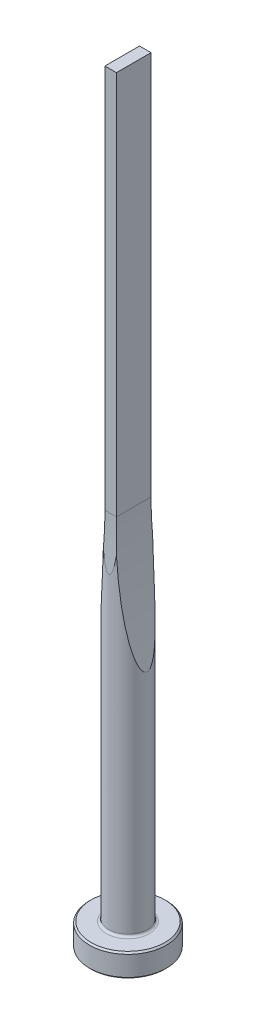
ISO-10303-21;
HEADER;
FILE_DESCRIPTION(('STEP AP214'),'2;1');
FILE_NAME('part.step','',(''),(''),'','','');
FILE_SCHEMA(('AUTOMOTIVE_DESIGN { 1 0 10303 214 1 1 1 1 }'));
ENDSEC;
DATA;
#1=APPLICATION_CONTEXT('core data for automotive mechanical design processes');
#2=APPLICATION_PROTOCOL_DEFINITION('international standard','automotive_design',2000,#1);
#3=PRODUCT_CONTEXT('',#1,'mechanical');
#4=PRODUCT('Part','Part','',(#3));
#5=PRODUCT_RELATED_PRODUCT_CATEGORY('part','',(#4));
#6=PRODUCT_DEFINITION_FORMATION('','',#4);
#7=PRODUCT_DEFINITION_CONTEXT('part definition',#1,'design');
#8=PRODUCT_DEFINITION('design','',#6,#7);
#9=PRODUCT_DEFINITION_SHAPE('','',#8);
#10=(LENGTH_UNIT() NAMED_UNIT(*) SI_UNIT(.MILLI.,.METRE.));
#11=(NAMED_UNIT(*) PLANE_ANGLE_UNIT() SI_UNIT($,.RADIAN.));
#12=(NAMED_UNIT(*) SI_UNIT($,.STERADIAN.) SOLID_ANGLE_UNIT());
#13=UNCERTAINTY_MEASURE_WITH_UNIT(LENGTH_MEASURE(1.E-05),#10,'distance_accuracy_value','');
#14=(GEOMETRIC_REPRESENTATION_CONTEXT(3) GLOBAL_UNCERTAINTY_ASSIGNED_CONTEXT((#13)) GLOBAL_UNIT_ASSIGNED_CONTEXT((#10,
#11,#12)) REPRESENTATION_CONTEXT('',''));
#15=CARTESIAN_POINT('',(0.,0.,0.));
#16=DIRECTION('',(0.,0.,1.));
#17=DIRECTION('',(1.,0.,0.));
#18=AXIS2_PLACEMENT_3D('',#15,#16,#17);
#19=CARTESIAN_POINT('',(0.,0.,0.));
#20=DIRECTION('',(0.,1.,0.));
#21=DIRECTION('',(-1.,0.,0.));
#22=AXIS2_PLACEMENT_3D('',#19,#20,#21);
#23=PLANE('',#22);
#24=CARTESIAN_POINT('',(0.,0.,0.));
#25=DIRECTION('',(0.,1.,0.));
#26=DIRECTION('',(-1.,0.,0.));
#27=AXIS2_PLACEMENT_3D('',#24,#25,#26);
#28=CIRCLE('',#27,4.8);
#29=CARTESIAN_POINT('',(-4.8,0.,0.));
#30=VERTEX_POINT('',#29);
#31=EDGE_CURVE('E133',#30,#30,#28,.T.);
#32=ORIENTED_EDGE('',*,*,#31,.F.);
#33=EDGE_LOOP('',(#32));
#34=FACE_BOUND('',#33,.T.);
#35=ADVANCED_FACE('F32',(#34),#23,.F.);
#36=CARTESIAN_POINT('',(0.,0.,0.));
#37=DIRECTION('',(0.,1.,0.));
#38=DIRECTION('',(-1.,0.,0.));
#39=AXIS2_PLACEMENT_3D('',#36,#37,#38);
#40=CONICAL_SURFACE('',#39,4.8,0.785398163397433);
#41=CARTESIAN_POINT('',(0.,0.200000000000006,0.));
#42=DIRECTION('',(0.,1.,0.));
#43=DIRECTION('',(-1.,0.,0.));
#44=AXIS2_PLACEMENT_3D('',#41,#42,#43);
#45=CIRCLE('',#44,5.);
#46=CARTESIAN_POINT('',(-5.,0.200000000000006,0.));
#47=VERTEX_POINT('',#46);
#48=EDGE_CURVE('E130',#47,#47,#45,.T.);
#49=ORIENTED_EDGE('',*,*,#48,.F.);
#50=EDGE_LOOP('',(#49));
#51=FACE_BOUND('',#50,.T.);
#52=ORIENTED_EDGE('',*,*,#31,.T.);
#53=EDGE_LOOP('',(#52));
#54=FACE_BOUND('',#53,.T.);
#55=ADVANCED_FACE('F171',(#51,#54),#40,.T.);
#56=CARTESIAN_POINT('',(0.,100.,0.));
#57=DIRECTION('',(0.,1.,0.));
#58=DIRECTION('',(-1.,0.,0.));
#59=AXIS2_PLACEMENT_3D('',#56,#57,#58);
#60=CYLINDRICAL_SURFACE('',#59,5.);
#61=CARTESIAN_POINT('',(0.,2.8,0.));
#62=DIRECTION('',(0.,1.,0.));
#63=DIRECTION('',(-1.,0.,0.));
#64=AXIS2_PLACEMENT_3D('',#61,#62,#63);
#65=CIRCLE('',#64,5.);
#66=CARTESIAN_POINT('',(-5.,2.8,0.));
#67=VERTEX_POINT('',#66);
#68=EDGE_CURVE('E127',#67,#67,#65,.T.);
#69=ORIENTED_EDGE('',*,*,#68,.F.);
#70=EDGE_LOOP('',(#69));
#71=FACE_BOUND('',#70,.T.);
#72=ORIENTED_EDGE('',*,*,#48,.T.);
#73=EDGE_LOOP('',(#72));
#74=FACE_BOUND('',#73,.T.);
#75=ADVANCED_FACE('F176',(#71,#74),#60,.T.);
#76=CARTESIAN_POINT('',(0.,2.8,0.));
#77=DIRECTION('',(0.,-1.,0.));
#78=DIRECTION('',(1.,0.,0.));
#79=AXIS2_PLACEMENT_3D('',#76,#77,#78);
#80=CONICAL_SURFACE('',#79,5.,0.785398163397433);
#81=CARTESIAN_POINT('',(0.,3.,0.));
#82=DIRECTION('',(0.,1.,0.));
#83=DIRECTION('',(-1.,0.,0.));
#84=AXIS2_PLACEMENT_3D('',#81,#82,#83);
#85=CIRCLE('',#84,4.8);
#86=CARTESIAN_POINT('',(-4.8,3.,0.));
#87=VERTEX_POINT('',#86);
#88=EDGE_CURVE('E124',#87,#87,#85,.T.);
#89=ORIENTED_EDGE('',*,*,#88,.F.);
#90=EDGE_LOOP('',(#89));
#91=FACE_BOUND('',#90,.T.);
#92=ORIENTED_EDGE('',*,*,#68,.T.);
#93=EDGE_LOOP('',(#92));
#94=FACE_BOUND('',#93,.T.);
#95=ADVANCED_FACE('F183',(#91,#94),#80,.T.);
#96=CARTESIAN_POINT('',(4.8,3.,0.));
#97=DIRECTION('',(0.,-1.,0.));
#98=DIRECTION('',(1.,0.,0.));
#99=AXIS2_PLACEMENT_3D('',#96,#97,#98);
#100=PLANE('',#99);
#101=CARTESIAN_POINT('',(0.,3.,0.));
#102=DIRECTION('',(0.,1.,0.));
#103=DIRECTION('',(-1.,0.,0.));
#104=AXIS2_PLACEMENT_3D('',#101,#102,#103);
#105=CIRCLE('',#104,2.80000000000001);
#106=CARTESIAN_POINT('',(-2.80000000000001,3.,0.));
#107=VERTEX_POINT('',#106);
#108=EDGE_CURVE('E121',#107,#107,#105,.T.);
#109=ORIENTED_EDGE('',*,*,#108,.F.);
#110=EDGE_LOOP('',(#109));
#111=FACE_BOUND('',#110,.T.);
#112=ORIENTED_EDGE('',*,*,#88,.T.);
#113=EDGE_LOOP('',(#112));
#114=FACE_BOUND('',#113,.T.);
#115=ADVANCED_FACE('F190',(#111,#114),#100,.F.);
#116=CARTESIAN_POINT('',(0.,3.3,0.));
#117=DIRECTION('',(0.,1.,0.));
#118=DIRECTION('',(-1.,0.,0.));
#119=AXIS2_PLACEMENT_3D('',#116,#117,#118);
#120=TOROIDAL_SURFACE('',#119,2.80000000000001,0.299999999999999);
#121=CARTESIAN_POINT('',(0.,3.3,0.));
#122=DIRECTION('',(0.,1.,0.));
#123=DIRECTION('',(-1.,0.,0.));
#124=AXIS2_PLACEMENT_3D('',#121,#122,#123);
#125=CIRCLE('',#124,2.50000000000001);
#126=CARTESIAN_POINT('',(-2.50000000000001,3.3,0.));
#127=VERTEX_POINT('',#126);
#128=EDGE_CURVE('E112',#127,#127,#125,.T.);
#129=ORIENTED_EDGE('',*,*,#128,.F.);
#130=EDGE_LOOP('',(#129));
#131=FACE_BOUND('',#130,.T.);
#132=ORIENTED_EDGE('',*,*,#108,.T.);
#133=EDGE_LOOP('',(#132));
#134=FACE_BOUND('',#133,.T.);
#135=ADVANCED_FACE('F168',(#131,#134),#120,.F.);
#136=CARTESIAN_POINT('',(0.,100.,0.));
#137=DIRECTION('',(0.,1.,0.));
#138=DIRECTION('',(-1.,0.,0.));
#139=AXIS2_PLACEMENT_3D('',#136,#137,#138);
#140=CYLINDRICAL_SURFACE('',#139,2.50000000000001);
#141=CARTESIAN_POINT('',(2.50000000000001,32.3382475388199,0.));
#142=CARTESIAN_POINT('',(2.49999974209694,32.3382488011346,0.0299639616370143));
#143=CARTESIAN_POINT('',(2.49945492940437,32.3409704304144,0.0599326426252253));
#144=CARTESIAN_POINT('',(2.49734508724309,32.3515176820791,0.118923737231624));
#145=CARTESIAN_POINT('',(2.49577876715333,32.3593497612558,0.14794490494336));
#146=CARTESIAN_POINT('',(2.49121080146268,32.3822164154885,0.212615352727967));
#147=CARTESIAN_POINT('',(2.48792379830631,32.3986852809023,0.247729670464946));
#148=CARTESIAN_POINT('',(2.48032463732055,32.4368342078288,0.314860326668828));
#149=CARTESIAN_POINT('',(2.47601015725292,32.4585260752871,0.346869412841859));
#150=CARTESIAN_POINT('',(2.46314736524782,32.5233470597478,0.431132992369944));
#151=CARTESIAN_POINT('',(2.45387010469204,32.5702555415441,0.480325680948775));
#152=CARTESIAN_POINT('',(2.43420180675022,32.6701866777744,0.571697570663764));
#153=CARTESIAN_POINT('',(2.42380739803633,32.7232278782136,0.61385450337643));
#154=CARTESIAN_POINT('',(2.39667456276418,32.8624034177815,0.714096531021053));
#155=CARTESIAN_POINT('',(2.37952586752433,32.9510180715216,0.768584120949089));
#156=CARTESIAN_POINT('',(2.34463996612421,33.1328433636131,0.869175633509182));
#157=CARTESIAN_POINT('',(2.32690146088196,33.226064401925,0.915259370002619));
#158=CARTESIAN_POINT('',(2.29112604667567,33.4157610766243,1.0014622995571));
#159=CARTESIAN_POINT('',(2.27308805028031,33.5122514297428,1.04154834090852));
#160=CARTESIAN_POINT('',(2.23702945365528,33.7069387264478,1.11688630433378));
#161=CARTESIAN_POINT('',(2.21900885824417,33.805133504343,1.15214391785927));
#162=CARTESIAN_POINT('',(2.18226420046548,34.0072767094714,1.22036495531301));
#163=CARTESIAN_POINT('',(2.1635450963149,34.1112847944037,1.25315301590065));
#164=CARTESIAN_POINT('',(2.12630255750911,34.3203464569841,1.31534987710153));
#165=CARTESIAN_POINT('',(2.10777914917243,34.425400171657,1.3447582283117));
#166=CARTESIAN_POINT('',(2.05256679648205,34.7418487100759,1.42880939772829));
#167=CARTESIAN_POINT('',(2.01625464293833,34.954426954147,1.47924468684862));
#168=CARTESIAN_POINT('',(1.94480336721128,35.3820587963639,1.57198773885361));
#169=CARTESIAN_POINT('',(1.90966736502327,35.5971172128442,1.614275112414));
#170=CARTESIAN_POINT('',(1.84079713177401,36.0285523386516,1.6923872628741));
#171=CARTESIAN_POINT('',(1.80706250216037,36.2449286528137,1.72821388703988));
#172=CARTESIAN_POINT('',(1.74100855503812,36.6790490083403,1.79473825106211));
#173=CARTESIAN_POINT('',(1.70869167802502,36.896794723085,1.82542738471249));
#174=CARTESIAN_POINT('',(1.64558005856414,37.3330771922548,1.88251828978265));
#175=CARTESIAN_POINT('',(1.61478541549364,37.5516139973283,1.90891978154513));
#176=CARTESIAN_POINT('',(1.55479846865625,37.9889770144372,1.95808655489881));
#177=CARTESIAN_POINT('',(1.52560384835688,38.2078023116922,1.98085718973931));
#178=CARTESIAN_POINT('',(1.46879105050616,38.645946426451,2.02334050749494));
#179=CARTESIAN_POINT('',(1.44117284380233,38.8652652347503,2.04305324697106));
#180=CARTESIAN_POINT('',(1.36084292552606,39.5227284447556,2.09817602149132));
#181=CARTESIAN_POINT('',(1.31050324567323,39.9614924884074,2.12969084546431));
#182=CARTESIAN_POINT('',(1.21624303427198,40.8402145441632,2.18488367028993));
#183=CARTESIAN_POINT('',(1.17232299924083,41.280172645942,2.20856106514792));
#184=CARTESIAN_POINT('',(1.09093979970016,42.1610823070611,2.24987380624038));
#185=CARTESIAN_POINT('',(1.05347835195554,42.6020340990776,2.2675075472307));
#186=CARTESIAN_POINT('',(0.985053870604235,43.4846060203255,2.29805773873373));
#187=CARTESIAN_POINT('',(0.95409092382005,43.9262261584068,2.31097412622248));
#188=CARTESIAN_POINT('',(0.898630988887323,44.8107601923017,2.33309967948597));
#189=CARTESIAN_POINT('',(0.874145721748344,45.2536749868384,2.34230214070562));
#190=CARTESIAN_POINT('',(0.831724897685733,46.1398716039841,2.35769843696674));
#191=CARTESIAN_POINT('',(0.813789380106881,46.5831534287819,2.36389225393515));
#192=CARTESIAN_POINT('',(0.784477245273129,47.4698869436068,2.37378057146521));
#193=CARTESIAN_POINT('',(0.77309953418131,47.9133385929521,2.37747548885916));
#194=CARTESIAN_POINT('',(0.75690196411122,48.8003809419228,2.38268159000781));
#195=CARTESIAN_POINT('',(0.752082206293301,49.2439716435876,2.38419274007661));
#196=CARTESIAN_POINT('',(0.749003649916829,50.1308026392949,2.38516164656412));
#197=CARTESIAN_POINT('',(0.750739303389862,50.5740429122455,2.38462113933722));
#198=CARTESIAN_POINT('',(0.760758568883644,51.4604353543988,2.38144371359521));
#199=CARTESIAN_POINT('',(0.769042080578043,51.9035875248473,2.37880682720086));
#200=CARTESIAN_POINT('',(0.79215600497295,52.7897658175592,2.37121007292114));
#201=CARTESIAN_POINT('',(0.806987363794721,53.2327919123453,2.36624986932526));
#202=CARTESIAN_POINT('',(0.84319203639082,54.1185365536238,2.35359207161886));
#203=CARTESIAN_POINT('',(0.864565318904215,54.5612551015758,2.34589449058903));
#204=CARTESIAN_POINT('',(0.913809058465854,55.4456067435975,2.3271542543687));
#205=CARTESIAN_POINT('',(0.941669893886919,55.8872404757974,2.31611654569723));
#206=CARTESIAN_POINT('',(1.00389211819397,56.7699234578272,2.28983487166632));
#207=CARTESIAN_POINT('',(1.0382534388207,57.2109727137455,2.27459095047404));
#208=CARTESIAN_POINT('',(1.11344668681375,58.0922077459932,2.23874335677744));
#209=CARTESIAN_POINT('',(1.15427720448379,58.5323936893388,2.21814085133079));
#210=CARTESIAN_POINT('',(1.24237727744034,59.4117313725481,2.1700304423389));
#211=CARTESIAN_POINT('',(1.28964643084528,59.8508831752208,2.14252296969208));
#212=CARTESIAN_POINT('',(1.36514966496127,60.5069756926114,2.0945731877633));
#213=CARTESIAN_POINT('',(1.39098157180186,60.7244460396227,2.07754923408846));
#214=CARTESIAN_POINT('',(1.44420470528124,61.1589800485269,2.04091149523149));
#215=CARTESIAN_POINT('',(1.47159593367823,61.3760437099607,2.02129770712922));
#216=CARTESIAN_POINT('',(1.52793970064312,61.8098188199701,1.97905052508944));
#217=CARTESIAN_POINT('',(1.55689322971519,62.0265299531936,1.95641520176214));
#218=CARTESIAN_POINT('',(1.61632244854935,62.4593433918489,1.90761148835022));
#219=CARTESIAN_POINT('',(1.64679810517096,62.675445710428,1.8814431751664));
#220=CARTESIAN_POINT('',(1.70918811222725,63.1065315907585,1.82495082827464));
#221=CARTESIAN_POINT('',(1.74109999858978,63.3215164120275,1.79463374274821));
#222=CARTESIAN_POINT('',(1.80636001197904,63.7504896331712,1.72893369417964));
#223=CARTESIAN_POINT('',(1.83970806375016,63.9644780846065,1.69355099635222));
#224=CARTESIAN_POINT('',(1.90773443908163,64.3909147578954,1.61653581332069));
#225=CARTESIAN_POINT('',(1.94241150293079,64.6033642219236,1.57490914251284));
#226=CARTESIAN_POINT('',(2.01299593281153,65.0263109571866,1.48364476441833));
#227=CARTESIAN_POINT('',(2.04890293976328,65.2368087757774,1.43400937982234));
#228=CARTESIAN_POINT('',(2.10356476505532,65.550590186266,1.35133144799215));
#229=CARTESIAN_POINT('',(2.12194676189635,65.6550097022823,1.32235225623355));
#230=CARTESIAN_POINT('',(2.15891519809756,65.8628758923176,1.26109909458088));
#231=CARTESIAN_POINT('',(2.1775016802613,65.9663223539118,1.22882442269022));
#232=CARTESIAN_POINT('',(2.2147265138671,66.1714617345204,1.16038706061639));
#233=CARTESIAN_POINT('',(2.23336438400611,66.2731599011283,1.12423994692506));
#234=CARTESIAN_POINT('',(2.27063774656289,66.4746146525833,1.04692674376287));
#235=CARTESIAN_POINT('',(2.28927323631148,66.5743720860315,1.00576290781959));
#236=CARTESIAN_POINT('',(2.32118376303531,66.743646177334,0.92914540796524));
#237=CARTESIAN_POINT('',(2.33451045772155,66.8138685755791,0.895279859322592));
#238=CARTESIAN_POINT('',(2.36098921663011,66.9525150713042,0.822941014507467));
#239=CARTESIAN_POINT('',(2.3741398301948,67.0209264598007,0.784442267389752));
#240=CARTESIAN_POINT('',(2.39524086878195,67.1300442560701,0.716644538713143));
#241=CARTESIAN_POINT('',(2.40334612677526,67.1717931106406,0.689078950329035));
#242=CARTESIAN_POINT('',(2.41922653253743,67.2532946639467,0.631069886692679));
#243=CARTESIAN_POINT('',(2.42700189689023,67.2930486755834,0.600628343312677));
#244=CARTESIAN_POINT('',(2.44198697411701,67.3694080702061,0.536450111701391));
#245=CARTESIAN_POINT('',(2.44920067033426,67.4060358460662,0.502741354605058));
#246=CARTESIAN_POINT('',(2.46282096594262,67.4749890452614,0.431091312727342));
#247=CARTESIAN_POINT('',(2.46922995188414,67.5073272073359,0.393163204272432));
#248=CARTESIAN_POINT('',(2.4787466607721,67.5552331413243,0.32637392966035));
#249=CARTESIAN_POINT('',(2.48222668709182,67.5727188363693,0.29895642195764));
#250=CARTESIAN_POINT('',(2.48843384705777,67.6038686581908,0.241907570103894));
#251=CARTESIAN_POINT('',(2.49116114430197,67.617533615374,0.212276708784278));
#252=CARTESIAN_POINT('',(2.49564729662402,67.6399933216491,0.150685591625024));
#253=CARTESIAN_POINT('',(2.49739396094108,67.648726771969,0.118701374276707));
#254=CARTESIAN_POINT('',(2.49963581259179,67.6599336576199,0.0536165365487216));
#255=CARTESIAN_POINT('',(2.5001329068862,67.6624166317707,0.0205176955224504));
#256=CARTESIAN_POINT('',(2.49982342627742,67.6608701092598,-0.0417297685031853));
#257=CARTESIAN_POINT('',(2.49915875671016,67.6575495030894,-0.0708993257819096));
#258=CARTESIAN_POINT('',(2.49687373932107,67.646125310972,-0.128247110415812));
#259=CARTESIAN_POINT('',(2.49525246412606,67.638017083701,-0.156424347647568));
#260=CARTESIAN_POINT('',(2.49052227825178,67.6143344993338,-0.220589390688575));
#261=CARTESIAN_POINT('',(2.4870942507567,67.5971552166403,-0.255953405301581));
#262=CARTESIAN_POINT('',(2.47921596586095,67.5575937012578,-0.323497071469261));
#263=CARTESIAN_POINT('',(2.47476326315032,67.5351990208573,-0.355668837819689));
#264=CARTESIAN_POINT('',(2.46140541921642,67.4678553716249,-0.441105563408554));
#265=CARTESIAN_POINT('',(2.45174732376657,67.4189932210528,-0.491122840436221));
#266=CARTESIAN_POINT('',(2.43131462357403,67.3150994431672,-0.583914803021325));
#267=CARTESIAN_POINT('',(2.42053657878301,67.260048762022,-0.626666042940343));
#268=CARTESIAN_POINT('',(2.39220322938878,67.1145507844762,-0.729097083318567));
#269=CARTESIAN_POINT('',(2.37422257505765,67.0214952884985,-0.784909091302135));
#270=CARTESIAN_POINT('',(2.33768776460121,66.830703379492,-0.887783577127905));
#271=CARTESIAN_POINT('',(2.31913233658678,66.7329562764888,-0.934824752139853));
#272=CARTESIAN_POINT('',(2.28174701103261,66.5341613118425,-1.02270155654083));
#273=CARTESIAN_POINT('',(2.26291618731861,66.4330989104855,-1.06350358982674));
#274=CARTESIAN_POINT('',(2.22530373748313,66.2292603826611,-1.14010298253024));
#275=CARTESIAN_POINT('',(2.20652207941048,66.12648647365,-1.17590632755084));
#276=CARTESIAN_POINT('',(2.16796672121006,65.9133843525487,-1.24563309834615));
#277=CARTESIAN_POINT('',(2.14820170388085,65.8029751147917,-1.27931195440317));
#278=CARTESIAN_POINT('',(2.10891098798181,65.5810797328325,-1.34308990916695));
#279=CARTESIAN_POINT('',(2.08938532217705,65.4695934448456,-1.37318852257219));
#280=CARTESIAN_POINT('',(2.03123427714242,65.1338097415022,-1.45907642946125));
#281=CARTESIAN_POINT('',(1.99305498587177,64.9082986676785,-1.51042296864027));
#282=CARTESIAN_POINT('',(1.91805831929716,64.4547277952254,-1.60457182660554));
#283=CARTESIAN_POINT('',(1.88124456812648,64.2266630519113,-1.64735257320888));
#284=CARTESIAN_POINT('',(1.80921725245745,63.7691961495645,-1.72614584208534));
#285=CARTESIAN_POINT('',(1.77400322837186,63.5397943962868,-1.7621603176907));
#286=CARTESIAN_POINT('',(1.7051703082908,63.0794720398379,-1.82884949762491));
#287=CARTESIAN_POINT('',(1.67155501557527,62.8485492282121,-1.85951252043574));
#288=CARTESIAN_POINT('',(1.60604860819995,62.3859000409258,-1.91637340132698));
#289=CARTESIAN_POINT('',(1.57415760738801,62.1541736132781,-1.94257096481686));
#290=CARTESIAN_POINT('',(1.51218248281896,61.6904475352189,-1.99119375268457));
#291=CARTESIAN_POINT('',(1.48209570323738,61.4584488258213,-2.01362461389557));
#292=CARTESIAN_POINT('',(1.42370026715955,60.9939516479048,-2.05532485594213));
#293=CARTESIAN_POINT('',(1.39539157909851,60.7614531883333,-2.07459429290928));
#294=CARTESIAN_POINT('',(1.31314873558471,60.0632640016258,-2.12837009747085));
#295=CARTESIAN_POINT('',(1.26190609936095,59.5969415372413,-2.15883771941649));
#296=CARTESIAN_POINT('',(1.16667979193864,58.663087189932,-2.21174240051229));
#297=CARTESIAN_POINT('',(1.1226966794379,58.1955552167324,-2.23417884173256));
#298=CARTESIAN_POINT('',(1.04202589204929,57.2594850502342,-2.2729240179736));
#299=CARTESIAN_POINT('',(1.00534020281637,56.7909466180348,-2.28923108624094));
#300=CARTESIAN_POINT('',(0.939305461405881,55.853211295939,-2.31710729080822));
#301=CARTESIAN_POINT('',(0.909956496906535,55.3840143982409,-2.32867637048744));
#302=CARTESIAN_POINT('',(0.858559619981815,54.4441951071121,-2.34811213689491));
#303=CARTESIAN_POINT('',(0.836526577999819,53.9735717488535,-2.35597129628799));
#304=CARTESIAN_POINT('',(0.799852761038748,53.0319948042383,-2.36867288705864));
#305=CARTESIAN_POINT('',(0.785212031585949,52.5610412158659,-2.37351529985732));
#306=CARTESIAN_POINT('',(0.763330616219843,51.6190301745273,-2.38064242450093));
#307=CARTESIAN_POINT('',(0.756088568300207,51.1479727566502,-2.38292760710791));
#308=CARTESIAN_POINT('',(0.749002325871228,50.2057982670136,-2.38516440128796));
#309=CARTESIAN_POINT('',(0.749158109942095,49.7346811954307,-2.38511601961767));
#310=CARTESIAN_POINT('',(0.75685343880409,48.7942225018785,-2.38268527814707));
#311=CARTESIAN_POINT('',(0.764366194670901,48.3248806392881,-2.38031138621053));
#312=CARTESIAN_POINT('',(0.786733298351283,47.3863892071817,-2.37301275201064));
#313=CARTESIAN_POINT('',(0.801587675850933,46.9172396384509,-2.36808799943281));
#314=CARTESIAN_POINT('',(0.838637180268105,45.9791496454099,-2.35522253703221));
#315=CARTESIAN_POINT('',(0.860834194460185,45.51020930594,-2.34728105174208));
#316=CARTESIAN_POINT('',(0.912557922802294,44.5728143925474,-2.32766070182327));
#317=CARTESIAN_POINT('',(0.942084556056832,44.1043598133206,-2.31598187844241));
#318=CARTESIAN_POINT('',(1.00838950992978,43.1689855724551,-2.28789158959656));
#319=CARTESIAN_POINT('',(1.04515412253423,42.7020646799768,-2.27148904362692));
#320=CARTESIAN_POINT('',(1.12594221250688,41.7691133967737,-2.23254700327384));
#321=CARTESIAN_POINT('',(1.16996553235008,41.303082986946,-2.21000764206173));
#322=CARTESIAN_POINT('',(1.26520845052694,40.3723956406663,-2.15690518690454));
#323=CARTESIAN_POINT('',(1.31642496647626,39.9077382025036,-2.12634552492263));
#324=CARTESIAN_POINT('',(1.3985903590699,39.2120375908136,-2.07243915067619));
#325=CARTESIAN_POINT('',(1.42686749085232,38.980362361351,-2.05312696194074));
#326=CARTESIAN_POINT('',(1.48518578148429,38.5175203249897,-2.01134664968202));
#327=CARTESIAN_POINT('',(1.51522689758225,38.2863535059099,-1.98887860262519));
#328=CARTESIAN_POINT('',(1.56799035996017,37.8923053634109,-1.9473513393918));
#329=CARTESIAN_POINT('',(1.59027725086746,37.7292674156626,-1.92922300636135));
#330=CARTESIAN_POINT('',(1.63571117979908,37.4035494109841,-1.89085534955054));
#331=CARTESIAN_POINT('',(1.65885826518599,37.2408693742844,-1.87061590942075));
#332=CARTESIAN_POINT('',(1.70598789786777,36.9160083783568,-1.82773646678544));
#333=CARTESIAN_POINT('',(1.72997013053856,36.7538272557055,-1.80509736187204));
#334=CARTESIAN_POINT('',(1.7787572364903,36.4300047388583,-1.75704135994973));
#335=CARTESIAN_POINT('',(1.80356208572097,36.268363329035,-1.73162454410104));
#336=CARTESIAN_POINT('',(1.8633089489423,35.8859565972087,-1.66752965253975));
#337=CARTESIAN_POINT('',(1.89860089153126,35.6654812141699,-1.6274278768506));
#338=CARTESIAN_POINT('',(1.97058347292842,35.2262152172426,-1.53949687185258));
#339=CARTESIAN_POINT('',(2.00727444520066,35.0074250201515,-1.49166579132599));
#340=CARTESIAN_POINT('',(2.07032920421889,34.6396855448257,-1.4020447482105));
#341=CARTESIAN_POINT('',(2.09638379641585,34.4900298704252,-1.36294933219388));
#342=CARTESIAN_POINT('',(2.14892380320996,34.192658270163,-1.2785205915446));
#343=CARTESIAN_POINT('',(2.17540887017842,34.0449409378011,-1.23319209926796));
#344=CARTESIAN_POINT('',(2.22058837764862,33.7964798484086,-1.1491389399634));
#345=CARTESIAN_POINT('',(2.23922250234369,33.6950098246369,-1.11254783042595));
#346=CARTESIAN_POINT('',(2.27650756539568,33.4938914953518,-1.03411981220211));
#347=CARTESIAN_POINT('',(2.29515847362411,33.3942467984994,-0.99227357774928));
#348=CARTESIAN_POINT('',(2.33340726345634,33.19174752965,-0.898861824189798));
#349=CARTESIAN_POINT('',(2.35299046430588,33.0890883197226,-0.846849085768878));
#350=CARTESIAN_POINT('',(2.38169709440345,32.939940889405,-0.76053805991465));
#351=CARTESIAN_POINT('',(2.39114177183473,32.8910973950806,-0.730433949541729));
#352=CARTESIAN_POINT('',(2.40967354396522,32.7956670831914,-0.666767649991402));
#353=CARTESIAN_POINT('',(2.41876094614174,32.7490783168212,-0.633208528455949));
#354=CARTESIAN_POINT('',(2.43460713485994,32.668158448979,-0.56882006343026));
#355=CARTESIAN_POINT('',(2.44146983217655,32.6332311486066,-0.538773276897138));
#356=CARTESIAN_POINT('',(2.45464081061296,32.566391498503,-0.475179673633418));
#357=CARTESIAN_POINT('',(2.4609478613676,32.5344858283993,-0.441625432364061));
#358=CARTESIAN_POINT('',(2.47276187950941,32.4748705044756,-0.369860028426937));
#359=CARTESIAN_POINT('',(2.47825506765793,32.4472328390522,-0.331585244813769));
#360=CARTESIAN_POINT('',(2.48775516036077,32.3995247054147,-0.250430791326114));
#361=CARTESIAN_POINT('',(2.49176985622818,32.37941455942,-0.207576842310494));
#362=CARTESIAN_POINT('',(2.49640282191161,32.3562287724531,-0.136623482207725));
#363=CARTESIAN_POINT('',(2.49773907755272,32.3495478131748,-0.109751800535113));
#364=CARTESIAN_POINT('',(2.49953747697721,32.3405581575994,-0.0552543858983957));
#365=CARTESIAN_POINT('',(2.50000023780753,32.3382463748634,-0.0276291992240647));
#366=CARTESIAN_POINT('',(2.50000000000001,32.3382475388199,0.));
#367=B_SPLINE_CURVE_WITH_KNOTS('',3,(#141,#142,#143,#144,#145,#146,#147,#148,#149,#150,#151,
#152,#153,#154,#155,#156,#157,#158,#159,#160,#161,#162,#163,#164,#165,#166,#167,#168,#169,#170,
#171,#172,#173,#174,#175,#176,#177,#178,#179,#180,#181,#182,#183,#184,#185,#186,#187,#188,#189,
#190,#191,#192,#193,#194,#195,#196,#197,#198,#199,#200,#201,#202,#203,#204,#205,#206,#207,#208,
#209,#210,#211,#212,#213,#214,#215,#216,#217,#218,#219,#220,#221,#222,#223,#224,#225,#226,#227,
#228,#229,#230,#231,#232,#233,#234,#235,#236,#237,#238,#239,#240,#241,#242,#243,#244,#245,#246,
#247,#248,#249,#250,#251,#252,#253,#254,#255,#256,#257,#258,#259,#260,#261,#262,#263,#264,#265,
#266,#267,#268,#269,#270,#271,#272,#273,#274,#275,#276,#277,#278,#279,#280,#281,#282,#283,#284,
#285,#286,#287,#288,#289,#290,#291,#292,#293,#294,#295,#296,#297,#298,#299,#300,#301,#302,#303,
#304,#305,#306,#307,#308,#309,#310,#311,#312,#313,#314,#315,#316,#317,#318,#319,#320,#321,#322,
#323,#324,#325,#326,#327,#328,#329,#330,#331,#332,#333,#334,#335,#336,#337,#338,#339,#340,#341,
#342,#343,#344,#345,#346,#347,#348,#349,#350,#351,#352,#353,#354,#355,#356,#357,#358,#359,#360,
#361,#362,#363,#364,#365,#366),.UNSPECIFIED.,.T.,.F.,(4,2,2,2,2,2,2,2,2,2,2,2,2,2,2,2,2,2,2,2,2,
2,2,2,2,2,2,2,2,2,2,2,2,2,2,2,2,2,2,2,2,2,2,2,2,2,2,2,2,2,2,2,2,2,2,2,2,2,2,2,2,2,2,2,2,2,2,2,2,
2,2,2,2,2,2,2,2,2,2,2,2,2,2,2,2,2,2,2,2,2,2,2,2,2,2,2,2,2,2,2,2,2,2,2,2,2,2,2,2,2,2,2,4),(0.,
0.0897803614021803,0.179674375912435,0.295781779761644,0.412154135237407,0.616804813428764,
0.82209141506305,1.13757616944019,1.45380901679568,1.77172990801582,2.08927276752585,
2.42114730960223,2.75306593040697,3.41723541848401,4.08304593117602,4.74866577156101,
5.4153897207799,6.08215713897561,6.747932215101,7.41369497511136,8.74183269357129,
10.07007308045,11.3986659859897,12.7272766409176,14.0582751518,15.3892816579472,
16.7200660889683,18.0508710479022,19.3805499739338,20.7102085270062,22.0400592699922,
23.3699036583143,24.6977881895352,26.0256587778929,27.3532404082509,28.6807392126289,
29.3397018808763,29.9986652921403,30.6580515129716,31.3174233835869,31.9757041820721,
32.633950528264,33.2915876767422,33.9490344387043,34.27873639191,34.6085087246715,
34.9370011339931,35.2653465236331,35.5025221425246,35.7410657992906,35.8930185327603,
36.044869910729,36.1955216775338,36.3457155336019,36.4435924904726,36.541448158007,
36.6404948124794,36.7393902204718,36.8270325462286,36.9147599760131,37.0324847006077,
37.1504933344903,37.3610616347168,37.5722969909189,37.9014204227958,38.2313331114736,
38.5629640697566,38.8941944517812,39.2454528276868,39.5967587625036,40.2997248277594,
41.0044395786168,41.7089505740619,42.4149806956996,43.1210573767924,43.8260678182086,
44.5310657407,45.9412503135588,47.3515433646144,48.7622196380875,50.1729127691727,
51.5864559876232,53.000007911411,54.4132995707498,55.8265871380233,57.2347475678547,
58.6429136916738,60.0514420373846,61.4599548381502,62.8658252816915,64.2716652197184,
65.6769045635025,66.3794590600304,67.0819965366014,67.578632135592,68.0752951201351,
68.5717729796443,69.0682363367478,69.7486949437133,70.4293167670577,70.8997916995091,
71.3699039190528,71.6981832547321,72.0270536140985,72.3767163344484,72.5510571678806,
72.7252445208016,72.8648209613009,73.0046990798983,73.1467259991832,73.2879933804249,
73.3708366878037,73.4536214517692),.UNSPECIFIED.);
#368=CARTESIAN_POINT('',(0.850781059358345,45.7420152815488,-2.35078105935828));
#369=VERTEX_POINT('',#368);
#370=CARTESIAN_POINT('',(0.850781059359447,45.7420152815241,2.35078105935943));
#371=VERTEX_POINT('',#370);
#372=EDGE_CURVE('E138',#369,#371,#367,.T.);
#373=ORIENTED_EDGE('',*,*,#372,.T.);
#374=CARTESIAN_POINT('',(-1.08972473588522,50.,2.24999999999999));
#375=CARTESIAN_POINT('',(-1.08973017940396,50.417843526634,2.25000007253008));
#376=CARTESIAN_POINT('',(-1.08376950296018,50.8356940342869,2.25291055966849));
#377=CARTESIAN_POINT('',(-1.059259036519,51.671226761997,2.26454765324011));
#378=CARTESIAN_POINT('',(-1.04070157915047,52.0889087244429,2.27327780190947));
#379=CARTESIAN_POINT('',(-1.0013960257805,52.715075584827,2.29071964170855));
#380=CARTESIAN_POINT('',(-0.986358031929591,52.9239852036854,2.29726834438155));
#381=CARTESIAN_POINT('',(-0.95179464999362,53.3413786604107,2.31180577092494));
#382=CARTESIAN_POINT('',(-0.932269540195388,53.5498625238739,2.31979440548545));
#383=CARTESIAN_POINT('',(-0.887770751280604,53.9659737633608,2.33718458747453));
#384=CARTESIAN_POINT('',(-0.862802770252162,54.17360180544,2.34658465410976));
#385=CARTESIAN_POINT('',(-0.805815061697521,54.5878049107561,2.36677025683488));
#386=CARTESIAN_POINT('',(-0.773797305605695,54.7943802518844,2.37755540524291));
#387=CARTESIAN_POINT('',(-0.718068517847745,55.1031004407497,2.39473279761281));
#388=CARTESIAN_POINT('',(-0.69817512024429,55.2059606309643,2.40063421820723));
#389=CARTESIAN_POINT('',(-0.655081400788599,55.4110633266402,2.41275302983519));
#390=CARTESIAN_POINT('',(-0.631878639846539,55.5133053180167,2.41897065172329));
#391=CARTESIAN_POINT('',(-0.581182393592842,55.7160803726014,2.43164611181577));
#392=CARTESIAN_POINT('',(-0.553714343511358,55.8166198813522,2.4381023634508));
#393=CARTESIAN_POINT('',(-0.492483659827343,56.0157234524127,2.45121963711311));
#394=CARTESIAN_POINT('',(-0.458730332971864,56.1142901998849,2.45788034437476));
#395=CARTESIAN_POINT('',(-0.406261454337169,56.2433039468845,2.4668042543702));
#396=CARTESIAN_POINT('',(-0.392361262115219,56.2756958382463,2.46906284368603));
#397=CARTESIAN_POINT('',(-0.362888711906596,56.3398145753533,2.47356778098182));
#398=CARTESIAN_POINT('',(-0.347312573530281,56.3715397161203,2.47581408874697));
#399=CARTESIAN_POINT('',(-0.312495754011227,56.4366837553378,2.48046026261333));
#400=CARTESIAN_POINT('',(-0.293050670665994,56.4699944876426,2.48285552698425));
#401=CARTESIAN_POINT('',(-0.250541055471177,56.534213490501,2.48750743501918));
#402=CARTESIAN_POINT('',(-0.227491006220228,56.5651306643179,2.4897645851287));
#403=CARTESIAN_POINT('',(-0.191076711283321,56.6052165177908,2.49270917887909));
#404=CARTESIAN_POINT('',(-0.180024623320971,56.6164519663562,2.49353684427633));
#405=CARTESIAN_POINT('',(-0.156763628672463,56.6377261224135,2.49510762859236));
#406=CARTESIAN_POINT('',(-0.144552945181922,56.6477629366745,2.49585061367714));
#407=CARTESIAN_POINT('',(-0.118634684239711,56.666196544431,2.49721781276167));
#408=CARTESIAN_POINT('',(-0.104907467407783,56.6745665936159,2.49784008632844));
#409=CARTESIAN_POINT('',(-0.0761165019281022,56.6885607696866,2.49888187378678));
#410=CARTESIAN_POINT('',(-0.0610589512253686,56.6941969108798,2.49930227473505));
#411=CARTESIAN_POINT('',(-0.0351108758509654,56.7005354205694,2.49977531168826));
#412=CARTESIAN_POINT('',(-0.0244691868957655,56.7022487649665,2.49990327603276));
#413=CARTESIAN_POINT('',(-0.00304761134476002,56.7038251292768,2.50002100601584));
#414=CARTESIAN_POINT('',(0.0077322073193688,56.7036890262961,2.5000108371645));
#415=CARTESIAN_POINT('',(0.0290836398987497,56.7015838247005,2.49985362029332));
#416=CARTESIAN_POINT('',(0.0396556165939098,56.6996182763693,2.49970683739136));
#417=CARTESIAN_POINT('',(0.0603614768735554,56.6940683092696,2.49929272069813));
#418=CARTESIAN_POINT('',(0.0704949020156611,56.6904822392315,2.49902526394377));
#419=CARTESIAN_POINT('',(0.0952035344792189,56.6798195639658,2.49823093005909));
#420=CARTESIAN_POINT('',(0.109407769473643,56.6718955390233,2.49764131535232));
#421=CARTESIAN_POINT('',(0.13643297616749,56.6539792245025,2.49631126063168));
#422=CARTESIAN_POINT('',(0.14924975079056,56.6439809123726,2.49557038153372));
#423=CARTESIAN_POINT('',(0.184823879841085,56.6128486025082,2.49326963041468));
#424=CARTESIAN_POINT('',(0.205953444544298,56.589892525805,2.49158038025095));
#425=CARTESIAN_POINT('',(0.245040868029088,56.541472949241,2.48803849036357));
#426=CARTESIAN_POINT('',(0.262988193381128,56.5160015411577,2.48618533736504));
#427=CARTESIAN_POINT('',(0.30925160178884,56.4439736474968,2.48097806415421));
#428=CARTESIAN_POINT('',(0.335237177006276,56.3959431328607,2.47754152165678));
#429=CARTESIAN_POINT('',(0.382999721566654,56.2978052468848,2.47060314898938));
#430=CARTESIAN_POINT('',(0.404765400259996,56.2476927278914,2.46710117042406));
#431=CARTESIAN_POINT('',(0.445440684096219,56.1460163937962,2.46008358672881));
#432=CARTESIAN_POINT('',(0.464334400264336,56.0944462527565,2.45656800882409));
#433=CARTESIAN_POINT('',(0.499871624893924,55.9906273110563,2.44958188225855));
#434=CARTESIAN_POINT('',(0.516518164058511,55.9383795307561,2.44611127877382));
#435=CARTESIAN_POINT('',(0.570055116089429,55.7604659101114,2.43445124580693));
#436=CARTESIAN_POINT('',(0.602958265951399,55.6335961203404,2.42640128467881));
#437=CARTESIAN_POINT('',(0.662697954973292,55.3783895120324,2.41075844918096));
#438=CARTESIAN_POINT('',(0.689530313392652,55.2500517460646,2.40316589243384));
#439=CARTESIAN_POINT('',(0.738831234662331,54.9922233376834,2.38847091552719));
#440=CARTESIAN_POINT('',(0.761290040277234,54.8627307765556,2.38136961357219));
#441=CARTESIAN_POINT('',(0.80278577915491,54.6031659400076,2.36770048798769));
#442=CARTESIAN_POINT('',(0.821822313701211,54.473093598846,2.36113272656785));
#443=CARTESIAN_POINT('',(0.874789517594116,54.082383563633,2.34225784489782));
#444=CARTESIAN_POINT('',(0.904596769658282,53.8211467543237,2.3307730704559));
#445=CARTESIAN_POINT('',(0.956195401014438,53.2981762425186,2.31007303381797));
#446=CARTESIAN_POINT('',(0.977997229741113,53.0364436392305,2.30085481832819));
#447=CARTESIAN_POINT('',(1.01364418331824,52.5340508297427,2.28536011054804));
#448=CARTESIAN_POINT('',(1.02799698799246,52.2934317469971,2.27890378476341));
#449=CARTESIAN_POINT('',(1.0520046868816,51.8119106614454,2.26791851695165));
#450=CARTESIAN_POINT('',(1.06165936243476,51.5710086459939,2.26338966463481));
#451=CARTESIAN_POINT('',(1.08427569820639,50.8477062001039,2.25269986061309));
#452=CARTESIAN_POINT('',(1.09086681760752,50.3650527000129,2.24944626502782));
#453=CARTESIAN_POINT('',(1.08826743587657,49.4005215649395,2.25070638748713));
#454=CARTESIAN_POINT('',(1.07910067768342,48.9186438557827,2.25520841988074));
#455=CARTESIAN_POINT('',(1.05232994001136,48.1965993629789,2.26774808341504));
#456=CARTESIAN_POINT('',(1.04124239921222,47.9561303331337,2.27288960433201));
#457=CARTESIAN_POINT('',(1.0141915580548,47.4755202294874,2.28509144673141));
#458=CARTESIAN_POINT('',(0.998228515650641,47.2353791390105,2.29215166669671));
#459=CARTESIAN_POINT('',(0.960610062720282,46.7558420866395,2.30816912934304));
#460=CARTESIAN_POINT('',(0.938960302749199,46.5164456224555,2.31712448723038));
#461=CARTESIAN_POINT('',(0.888559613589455,46.0381620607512,2.33692439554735));
#462=CARTESIAN_POINT('',(0.859800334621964,45.7992758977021,2.34777116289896));
#463=CARTESIAN_POINT('',(0.809334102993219,45.4415432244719,2.36543615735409));
#464=CARTESIAN_POINT('',(0.791245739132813,45.3221520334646,2.37157111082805));
#465=CARTESIAN_POINT('',(0.752062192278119,45.0838917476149,2.3842885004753));
#466=CARTESIAN_POINT('',(0.730967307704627,44.9650226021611,2.39087089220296));
#467=CARTESIAN_POINT('',(0.684984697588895,44.7283066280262,2.40444765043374));
#468=CARTESIAN_POINT('',(0.660105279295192,44.6104581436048,2.41144109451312));
#469=CARTESIAN_POINT('',(0.605188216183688,44.3760080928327,2.42581353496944));
#470=CARTESIAN_POINT('',(0.575153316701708,44.2594058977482,2.43319232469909));
#471=CARTESIAN_POINT('',(0.524064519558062,44.0857489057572,2.44451548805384));
#472=CARTESIAN_POINT('',(0.505939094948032,44.0278283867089,2.44834915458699));
#473=CARTESIAN_POINT('',(0.466994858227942,43.9127359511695,2.45607737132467));
#474=CARTESIAN_POINT('',(0.446170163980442,43.8555659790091,2.45997203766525));
#475=CARTESIAN_POINT('',(0.40098287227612,43.7431082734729,2.4677385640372));
#476=CARTESIAN_POINT('',(0.376646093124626,43.6878101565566,2.47161039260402));
#477=CARTESIAN_POINT('',(0.3225670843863,43.5799691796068,2.47925828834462));
#478=CARTESIAN_POINT('',(0.292848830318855,43.5274153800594,2.48303469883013));
#479=CARTESIAN_POINT('',(0.240881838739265,43.4531788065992,2.48842819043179));
#480=CARTESIAN_POINT('',(0.222183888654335,43.4290596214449,2.49019123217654));
#481=CARTESIAN_POINT('',(0.181321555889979,43.3840125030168,2.49350050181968));
#482=CARTESIAN_POINT('',(0.15918607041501,43.3630606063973,2.49504834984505));
#483=CARTESIAN_POINT('',(0.124664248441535,43.3379562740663,2.49690963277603));
#484=CARTESIAN_POINT('',(0.114221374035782,43.3311807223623,2.49741292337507));
#485=CARTESIAN_POINT('',(0.0924948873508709,43.3190904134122,2.49831208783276));
#486=CARTESIAN_POINT('',(0.0812111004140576,43.3137759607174,2.4987079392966));
#487=CARTESIAN_POINT('',(0.057752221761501,43.3050206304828,2.49936060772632));
#488=CARTESIAN_POINT('',(0.0455677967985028,43.3016038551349,2.49961563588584));
#489=CARTESIAN_POINT('',(0.0207704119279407,43.2972019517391,2.49994426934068));
#490=CARTESIAN_POINT('',(0.00815830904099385,43.2962122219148,2.50001821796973));
#491=CARTESIAN_POINT('',(-0.015555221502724,43.296770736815,2.49997650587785));
#492=CARTESIAN_POINT('',(-0.0266642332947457,43.2980412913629,2.49988159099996));
#493=CARTESIAN_POINT('',(-0.0485078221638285,43.3024391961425,2.49955329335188));
#494=CARTESIAN_POINT('',(-0.0592419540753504,43.3055686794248,2.49931975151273));
#495=CARTESIAN_POINT('',(-0.0837875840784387,43.3147484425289,2.49863544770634));
#496=CARTESIAN_POINT('',(-0.0973551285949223,43.3214386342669,2.49813719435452));
#497=CARTESIAN_POINT('',(-0.123276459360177,43.3368383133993,2.49699260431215));
#498=CARTESIAN_POINT('',(-0.135627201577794,43.3455526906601,2.49634590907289));
#499=CARTESIAN_POINT('',(-0.168932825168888,43.3721120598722,2.49437960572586));
#500=CARTESIAN_POINT('',(-0.188583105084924,43.3915600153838,2.49294489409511));
#501=CARTESIAN_POINT('',(-0.225097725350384,43.4328745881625,2.489912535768));
#502=CARTESIAN_POINT('',(-0.241952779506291,43.454748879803,2.48831437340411));
#503=CARTESIAN_POINT('',(-0.283874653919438,43.5145295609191,2.48397048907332));
#504=CARTESIAN_POINT('',(-0.307190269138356,43.5536442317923,2.48115187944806));
#505=CARTESIAN_POINT('',(-0.350288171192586,43.6337968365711,2.47543182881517));
#506=CARTESIAN_POINT('',(-0.370061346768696,43.6748393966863,2.47253019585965));
#507=CARTESIAN_POINT('',(-0.407174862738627,43.7582740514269,2.46669078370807));
#508=CARTESIAN_POINT('',(-0.424501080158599,43.8006723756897,2.46375289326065));
#509=CARTESIAN_POINT('',(-0.457204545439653,43.8861386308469,2.45789268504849));
#510=CARTESIAN_POINT('',(-0.472584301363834,43.9292056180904,2.45497035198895));
#511=CARTESIAN_POINT('',(-0.521348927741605,44.0734883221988,2.44528588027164));
#512=CARTESIAN_POINT('',(-0.551455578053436,44.1758119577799,2.43858951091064));
#513=CARTESIAN_POINT('',(-0.606551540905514,44.3818614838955,2.4254643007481));
#514=CARTESIAN_POINT('',(-0.631537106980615,44.485588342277,2.41903565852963));
#515=CARTESIAN_POINT('',(-0.677824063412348,44.6941236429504,2.40647709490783));
#516=CARTESIAN_POINT('',(-0.69911689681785,44.7989340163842,2.40034789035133));
#517=CARTESIAN_POINT('',(-0.738809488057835,45.0091243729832,2.38842728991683));
#518=CARTESIAN_POINT('',(-0.757208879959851,45.1145044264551,2.38263593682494));
#519=CARTESIAN_POINT('',(-0.808916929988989,45.4311534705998,2.36579508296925));
#520=CARTESIAN_POINT('',(-0.838753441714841,45.6430174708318,2.3552735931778));
#521=CARTESIAN_POINT('',(-0.891753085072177,46.0673268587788,2.33571214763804));
#522=CARTESIAN_POINT('',(-0.914924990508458,46.2797711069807,2.32667025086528));
#523=CARTESIAN_POINT('',(-0.96365303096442,46.7837885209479,2.30701281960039));
#524=CARTESIAN_POINT('',(-0.986928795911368,47.0756070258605,2.29704951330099));
#525=CARTESIAN_POINT('',(-1.02579741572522,47.659961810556,2.27995094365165));
#526=CARTESIAN_POINT('',(-1.04138647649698,47.9524983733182,2.27281707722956));
#527=CARTESIAN_POINT('',(-1.06593128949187,48.5374527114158,2.26140963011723));
#528=CARTESIAN_POINT('',(-1.07489717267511,48.8298699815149,2.25713168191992));
#529=CARTESIAN_POINT('',(-1.08679206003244,49.4148570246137,2.25142680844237));
#530=CARTESIAN_POINT('',(-1.08972092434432,49.7074268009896,2.24999994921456));
#531=CARTESIAN_POINT('',(-1.08972473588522,50.,2.24999999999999));
#532=B_SPLINE_CURVE_WITH_KNOTS('',3,(#374,#375,#376,#377,#378,#379,#380,#381,#382,#383,#384,
#385,#386,#387,#388,#389,#390,#391,#392,#393,#394,#395,#396,#397,#398,#399,#400,#401,#402,#403,
#404,#405,#406,#407,#408,#409,#410,#411,#412,#413,#414,#415,#416,#417,#418,#419,#420,#421,#422,
#423,#424,#425,#426,#427,#428,#429,#430,#431,#432,#433,#434,#435,#436,#437,#438,#439,#440,#441,
#442,#443,#444,#445,#446,#447,#448,#449,#450,#451,#452,#453,#454,#455,#456,#457,#458,#459,#460,
#461,#462,#463,#464,#465,#466,#467,#468,#469,#470,#471,#472,#473,#474,#475,#476,#477,#478,#479,
#480,#481,#482,#483,#484,#485,#486,#487,#488,#489,#490,#491,#492,#493,#494,#495,#496,#497,#498,
#499,#500,#501,#502,#503,#504,#505,#506,#507,#508,#509,#510,#511,#512,#513,#514,#515,#516,#517,
#518,#519,#520,#521,#522,#523,#524,#525,#526,#527,#528,#529,#530,#531),.UNSPECIFIED.,.T.,.F.,(4,
2,2,2,2,2,2,2,2,2,2,2,2,2,2,2,2,2,2,2,2,2,2,2,2,2,2,2,2,2,2,2,2,2,2,2,2,2,2,2,2,2,2,2,2,2,2,2,2,
2,2,2,2,2,2,2,2,2,2,2,2,2,2,2,2,2,2,2,2,2,2,2,2,2,2,2,2,2,4),(0.,1.25349579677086,
2.50775525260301,3.1363725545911,3.76495088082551,4.39287428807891,5.02062232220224,
5.33538342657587,5.65037772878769,5.96356106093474,6.27628429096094,6.38221512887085,
6.48839013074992,6.60421617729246,6.7195883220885,6.76687074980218,6.81422689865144,
6.8622906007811,6.91014112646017,6.94233304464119,6.97450969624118,7.00662403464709,
7.03877117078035,7.08731649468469,7.13600479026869,7.22921726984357,7.32273275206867,
7.48645092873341,7.65060127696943,7.81562908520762,7.98043205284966,8.37407968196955,
8.76799758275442,9.16278447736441,9.5576173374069,10.3469594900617,11.1352676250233,
11.8586053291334,12.5819766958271,14.02975144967,15.4753467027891,16.1976403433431,
16.919895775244,17.641436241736,18.3638281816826,18.7265281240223,19.0891920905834,
19.4510711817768,19.8127581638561,19.9951529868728,20.1779521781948,20.3594702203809,
20.5401986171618,20.631742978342,20.7225557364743,20.7598439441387,20.7971399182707,
20.8348993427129,20.8725871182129,20.9059585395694,20.9393683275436,20.9845173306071,
21.0297765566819,21.1123623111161,21.1952171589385,21.33173108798,21.4685912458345,
21.6062115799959,21.7436527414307,22.0640092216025,22.3845992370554,22.7059224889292,
23.0272863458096,23.6697499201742,24.3113637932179,25.1899528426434,26.0689751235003,
26.94665003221,27.8243452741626),.UNSPECIFIED.);
#533=CARTESIAN_POINT('',(-0.850781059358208,45.7420152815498,2.3507810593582));
#534=VERTEX_POINT('',#533);
#535=EDGE_CURVE('E104',#371,#534,#532,.T.);
#536=ORIENTED_EDGE('',*,*,#535,.T.);
#537=CARTESIAN_POINT('',(-2.50000000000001,32.3382475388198,0.));
#538=CARTESIAN_POINT('',(-2.49999974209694,32.3382488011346,-0.0299639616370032));
#539=CARTESIAN_POINT('',(-2.49945492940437,32.3409704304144,-0.0599326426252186));
#540=CARTESIAN_POINT('',(-2.49734508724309,32.351517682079,-0.118923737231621));
#541=CARTESIAN_POINT('',(-2.49577876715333,32.3593497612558,-0.147944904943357));
#542=CARTESIAN_POINT('',(-2.49121080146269,32.3822164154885,-0.212615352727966));
#543=CARTESIAN_POINT('',(-2.48792379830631,32.3986852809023,-0.247729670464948));
#544=CARTESIAN_POINT('',(-2.48032463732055,32.4368342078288,-0.314860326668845));
#545=CARTESIAN_POINT('',(-2.47601015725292,32.458526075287,-0.346869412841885));
#546=CARTESIAN_POINT('',(-2.46314736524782,32.5233470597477,-0.431132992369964));
#547=CARTESIAN_POINT('',(-2.45387010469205,32.5702555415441,-0.480325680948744));
#548=CARTESIAN_POINT('',(-2.43420180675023,32.6701866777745,-0.571697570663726));
#549=CARTESIAN_POINT('',(-2.42380739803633,32.7232278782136,-0.613854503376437));
#550=CARTESIAN_POINT('',(-2.39667456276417,32.8624034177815,-0.714096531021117));
#551=CARTESIAN_POINT('',(-2.37952586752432,32.9510180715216,-0.768584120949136));
#552=CARTESIAN_POINT('',(-2.3446399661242,33.1328433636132,-0.869175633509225));
#553=CARTESIAN_POINT('',(-2.32690146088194,33.2260644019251,-0.915259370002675));
#554=CARTESIAN_POINT('',(-2.29112604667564,33.4157610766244,-1.00146229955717));
#555=CARTESIAN_POINT('',(-2.27308805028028,33.5122514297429,-1.04154834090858));
#556=CARTESIAN_POINT('',(-2.23702945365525,33.7069387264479,-1.11688630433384));
#557=CARTESIAN_POINT('',(-2.21900885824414,33.8051335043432,-1.15214391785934));
#558=CARTESIAN_POINT('',(-2.18226420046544,34.0072767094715,-1.22036495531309));
#559=CARTESIAN_POINT('',(-2.16354509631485,34.1112847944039,-1.25315301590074));
#560=CARTESIAN_POINT('',(-2.12630255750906,34.3203464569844,-1.31534987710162));
#561=CARTESIAN_POINT('',(-2.10777914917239,34.4254001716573,-1.34475822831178));
#562=CARTESIAN_POINT('',(-2.05256679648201,34.7418487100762,-1.42880939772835));
#563=CARTESIAN_POINT('',(-2.01625464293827,34.9544269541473,-1.4792446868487));
#564=CARTESIAN_POINT('',(-1.9448033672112,35.3820587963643,-1.57198773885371));
#565=CARTESIAN_POINT('',(-1.90966736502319,35.5971172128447,-1.61427511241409));
#566=CARTESIAN_POINT('',(-1.84079713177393,36.0285523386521,-1.69238726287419));
#567=CARTESIAN_POINT('',(-1.80706250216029,36.2449286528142,-1.72821388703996));
#568=CARTESIAN_POINT('',(-1.74100855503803,36.6790490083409,-1.7947382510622));
#569=CARTESIAN_POINT('',(-1.70869167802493,36.8967947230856,-1.82542738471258));
#570=CARTESIAN_POINT('',(-1.64558005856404,37.3330771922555,-1.88251828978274));
#571=CARTESIAN_POINT('',(-1.61478541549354,37.5516139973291,-1.90891978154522));
#572=CARTESIAN_POINT('',(-1.55479846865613,37.9889770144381,-1.95808655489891));
#573=CARTESIAN_POINT('',(-1.52560384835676,38.2078023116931,-1.98085718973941));
#574=CARTESIAN_POINT('',(-1.46879105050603,38.6459464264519,-2.02334050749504));
#575=CARTESIAN_POINT('',(-1.44117284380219,38.8652652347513,-2.04305324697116));
#576=CARTESIAN_POINT('',(-1.36084292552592,39.5227284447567,-2.09817602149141));
#577=CARTESIAN_POINT('',(-1.3105032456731,39.9614924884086,-2.12969084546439));
#578=CARTESIAN_POINT('',(-1.21624303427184,40.8402145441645,-2.18488367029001));
#579=CARTESIAN_POINT('',(-1.17232299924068,41.2801726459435,-2.208561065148));
#580=CARTESIAN_POINT('',(-1.09093979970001,42.1610823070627,-2.24987380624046));
#581=CARTESIAN_POINT('',(-1.0534783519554,42.6020340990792,-2.26750754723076));
#582=CARTESIAN_POINT('',(-0.985053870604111,43.4846060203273,-2.29805773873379));
#583=CARTESIAN_POINT('',(-0.954090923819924,43.9262261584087,-2.31097412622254));
#584=CARTESIAN_POINT('',(-0.898630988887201,44.8107601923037,-2.33309967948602));
#585=CARTESIAN_POINT('',(-0.874145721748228,45.2536749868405,-2.34230214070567));
#586=CARTESIAN_POINT('',(-0.831724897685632,46.1398716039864,-2.35769843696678));
#587=CARTESIAN_POINT('',(-0.81378938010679,46.5831534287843,-2.36389225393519));
#588=CARTESIAN_POINT('',(-0.784477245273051,47.4698869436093,-2.37378057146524));
#589=CARTESIAN_POINT('',(-0.773099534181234,47.9133385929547,-2.37747548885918));
#590=CARTESIAN_POINT('',(-0.756901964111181,48.8003809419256,-2.38268159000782));
#591=CARTESIAN_POINT('',(-0.752082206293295,49.2439716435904,-2.38419274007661));
#592=CARTESIAN_POINT('',(-0.749003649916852,50.1308026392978,-2.38516164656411));
#593=CARTESIAN_POINT('',(-0.75073930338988,50.5740429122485,-2.38462113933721));
#594=CARTESIAN_POINT('',(-0.760758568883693,51.460435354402,-2.3814437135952));
#595=CARTESIAN_POINT('',(-0.769042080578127,51.9035875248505,-2.37880682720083));
#596=CARTESIAN_POINT('',(-0.792156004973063,52.7897658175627,-2.3712100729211));
#597=CARTESIAN_POINT('',(-0.806987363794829,53.2327919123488,-2.36624986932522));
#598=CARTESIAN_POINT('',(-0.843192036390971,54.1185365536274,-2.35359207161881));
#599=CARTESIAN_POINT('',(-0.864565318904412,54.5612551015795,-2.34589449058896));
#600=CARTESIAN_POINT('',(-0.913809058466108,55.4456067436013,-2.32715425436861));
#601=CARTESIAN_POINT('',(-0.941669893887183,55.8872404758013,-2.31611654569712));
#602=CARTESIAN_POINT('',(-1.00389211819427,56.7699234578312,-2.28983487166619));
#603=CARTESIAN_POINT('',(-1.03825343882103,57.2109727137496,-2.27459095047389));
#604=CARTESIAN_POINT('',(-1.11344668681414,58.0922077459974,-2.23874335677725));
#605=CARTESIAN_POINT('',(-1.15427720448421,58.5323936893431,-2.21814085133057));
#606=CARTESIAN_POINT('',(-1.2423772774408,59.4117313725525,-2.17003044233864));
#607=CARTESIAN_POINT('',(-1.28964643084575,59.8508831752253,-2.1425229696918));
#608=CARTESIAN_POINT('',(-1.3651496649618,60.5069756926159,-2.09457318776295));
#609=CARTESIAN_POINT('',(-1.39098157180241,60.7244460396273,-2.07754923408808));
#610=CARTESIAN_POINT('',(-1.44420470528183,61.1589800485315,-2.04091149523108));
#611=CARTESIAN_POINT('',(-1.47159593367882,61.3760437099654,-2.02129770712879));
#612=CARTESIAN_POINT('',(-1.52793970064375,61.8098188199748,-1.97905052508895));
#613=CARTESIAN_POINT('',(-1.55689322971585,62.0265299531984,-1.95641520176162));
#614=CARTESIAN_POINT('',(-1.61632244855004,62.4593433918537,-1.90761148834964));
#615=CARTESIAN_POINT('',(-1.64679810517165,62.6754457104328,-1.8814431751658));
#616=CARTESIAN_POINT('',(-1.70918811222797,63.1065315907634,-1.82495082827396));
#617=CARTESIAN_POINT('',(-1.74109999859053,63.3215164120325,-1.79463374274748));
#618=CARTESIAN_POINT('',(-1.80636001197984,63.7504896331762,-1.72893369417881));
#619=CARTESIAN_POINT('',(-1.83970806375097,63.9644780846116,-1.69355099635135));
#620=CARTESIAN_POINT('',(-1.90773443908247,64.3909147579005,-1.61653581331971));
#621=CARTESIAN_POINT('',(-1.94241150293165,64.6033642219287,-1.57490914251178));
#622=CARTESIAN_POINT('',(-2.01299593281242,65.0263109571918,-1.48364476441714));
#623=CARTESIAN_POINT('',(-2.04890293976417,65.2368087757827,-1.43400937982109));
#624=CARTESIAN_POINT('',(-2.10356476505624,65.5505901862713,-1.35133144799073));
#625=CARTESIAN_POINT('',(-2.12194676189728,65.6550097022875,-1.32235225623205));
#626=CARTESIAN_POINT('',(-2.15891519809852,65.8628758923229,-1.26109909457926));
#627=CARTESIAN_POINT('',(-2.17750168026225,65.9663223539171,-1.22882442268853));
#628=CARTESIAN_POINT('',(-2.21472651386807,66.1714617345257,-1.16038706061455));
#629=CARTESIAN_POINT('',(-2.23336438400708,66.2731599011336,-1.12423994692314));
#630=CARTESIAN_POINT('',(-2.27063774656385,66.4746146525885,-1.04692674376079));
#631=CARTESIAN_POINT('',(-2.28927323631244,66.5743720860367,-1.00576290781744));
#632=CARTESIAN_POINT('',(-2.32118376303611,66.7436461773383,-0.92914540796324));
#633=CARTESIAN_POINT('',(-2.3345104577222,66.8138685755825,-0.895279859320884));
#634=CARTESIAN_POINT('',(-2.36098921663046,66.9525150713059,-0.822941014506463));
#635=CARTESIAN_POINT('',(-2.37413983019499,67.0209264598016,-0.784442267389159));
#636=CARTESIAN_POINT('',(-2.39524086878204,67.1300442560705,-0.716644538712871));
#637=CARTESIAN_POINT('',(-2.4033461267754,67.1717931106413,-0.689078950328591));
#638=CARTESIAN_POINT('',(-2.41922653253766,67.2532946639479,-0.631069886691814));
#639=CARTESIAN_POINT('',(-2.42700189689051,67.2930486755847,-0.600628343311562));
#640=CARTESIAN_POINT('',(-2.44198697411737,67.3694080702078,-0.536450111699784));
#641=CARTESIAN_POINT('',(-2.44920067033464,67.4060358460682,-0.502741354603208));
#642=CARTESIAN_POINT('',(-2.46282096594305,67.4749890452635,-0.431091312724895));
#643=CARTESIAN_POINT('',(-2.4692299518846,67.5073272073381,-0.393163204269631));
#644=CARTESIAN_POINT('',(-2.47874666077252,67.5552331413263,-0.326373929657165));
#645=CARTESIAN_POINT('',(-2.4822266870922,67.5727188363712,-0.298956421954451));
#646=CARTESIAN_POINT('',(-2.48843384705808,67.6038686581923,-0.241907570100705));
#647=CARTESIAN_POINT('',(-2.49116114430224,67.6175336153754,-0.212276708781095));
#648=CARTESIAN_POINT('',(-2.49564729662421,67.63999332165,-0.150685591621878));
#649=CARTESIAN_POINT('',(-2.49739396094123,67.6487267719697,-0.118701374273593));
#650=CARTESIAN_POINT('',(-2.49963581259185,67.6599336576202,-0.0536165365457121));
#651=CARTESIAN_POINT('',(-2.50013290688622,67.6624166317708,-0.020517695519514));
#652=CARTESIAN_POINT('',(-2.49982342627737,67.6608701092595,0.0417297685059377));
#653=CARTESIAN_POINT('',(-2.49915875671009,67.657549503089,0.0708993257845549));
#654=CARTESIAN_POINT('',(-2.49687373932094,67.6461253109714,0.128247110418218));
#655=CARTESIAN_POINT('',(-2.49525246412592,67.6380170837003,0.156424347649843));
#656=CARTESIAN_POINT('',(-2.49052227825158,67.6143344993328,0.220589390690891));
#657=CARTESIAN_POINT('',(-2.48709425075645,67.5971552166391,0.255953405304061));
#658=CARTESIAN_POINT('',(-2.47921596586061,67.5575937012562,0.323497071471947));
#659=CARTESIAN_POINT('',(-2.47476326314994,67.5351990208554,0.355668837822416));
#660=CARTESIAN_POINT('',(-2.46140541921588,67.4678553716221,0.441105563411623));
#661=CARTESIAN_POINT('',(-2.4517473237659,67.4189932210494,0.491122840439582));
#662=CARTESIAN_POINT('',(-2.43131462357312,67.3150994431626,0.583914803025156));
#663=CARTESIAN_POINT('',(-2.42053657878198,67.2600487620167,0.62666604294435));
#664=CARTESIAN_POINT('',(-2.39220322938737,67.1145507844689,0.729097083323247));
#665=CARTESIAN_POINT('',(-2.37422257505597,67.0214952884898,0.784909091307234));
#666=CARTESIAN_POINT('',(-2.33768776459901,66.8307033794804,0.887783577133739));
#667=CARTESIAN_POINT('',(-2.31913233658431,66.7329562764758,0.934824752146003));
#668=CARTESIAN_POINT('',(-2.28174701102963,66.5341613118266,1.0227015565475));
#669=CARTESIAN_POINT('',(-2.26291618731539,66.4330989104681,1.06350358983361));
#670=CARTESIAN_POINT('',(-2.22530373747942,66.2292603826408,1.1401029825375));
#671=CARTESIAN_POINT('',(-2.20652207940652,66.1264864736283,1.17590632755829));
#672=CARTESIAN_POINT('',(-2.16796672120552,65.9133843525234,1.24563309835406));
#673=CARTESIAN_POINT('',(-2.148201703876,65.8029751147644,1.27931195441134));
#674=CARTESIAN_POINT('',(-2.1089109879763,65.5810797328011,1.34308990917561));
#675=CARTESIAN_POINT('',(-2.08938532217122,65.4695934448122,1.37318852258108));
#676=CARTESIAN_POINT('',(-2.03123427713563,65.1338097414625,1.45907642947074));
#677=CARTESIAN_POINT('',(-1.99305498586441,64.9082986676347,1.51042296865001));
#678=CARTESIAN_POINT('',(-1.91805831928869,64.4547277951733,1.60457182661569));
#679=CARTESIAN_POINT('',(-1.88124456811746,64.2266630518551,1.64735257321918));
#680=CARTESIAN_POINT('',(-1.80921725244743,63.7691961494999,1.72614584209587));
#681=CARTESIAN_POINT('',(-1.77400322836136,63.539794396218,1.76216031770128));
#682=CARTESIAN_POINT('',(-1.70517030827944,63.0794720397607,1.82884949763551));
#683=CARTESIAN_POINT('',(-1.67155501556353,62.8485492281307,1.85951252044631));
#684=CARTESIAN_POINT('',(-1.60604860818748,62.385900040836,1.91637340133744));
#685=CARTESIAN_POINT('',(-1.57415760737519,62.1541736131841,1.94257096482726));
#686=CARTESIAN_POINT('',(-1.51218248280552,61.6904475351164,1.99119375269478));
#687=CARTESIAN_POINT('',(-1.48209570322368,61.4584488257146,2.01362461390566));
#688=CARTESIAN_POINT('',(-1.42370026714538,60.9939516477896,2.05532485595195));
#689=CARTESIAN_POINT('',(-1.39539157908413,60.7614531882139,2.07459429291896));
#690=CARTESIAN_POINT('',(-1.31314873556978,60.0632640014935,2.12837009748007));
#691=CARTESIAN_POINT('',(-1.26190609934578,59.5969415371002,2.15883771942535));
#692=CARTESIAN_POINT('',(-1.16667979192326,58.6630871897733,2.2117424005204));
#693=CARTESIAN_POINT('',(-1.12269667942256,58.1955552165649,2.23417884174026));
#694=CARTESIAN_POINT('',(-1.04202589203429,57.2594850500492,2.27292401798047));
#695=CARTESIAN_POINT('',(-1.00534020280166,56.790946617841,2.28923108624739));
#696=CARTESIAN_POINT('',(-0.939305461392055,55.8532112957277,2.31710729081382));
#697=CARTESIAN_POINT('',(-0.909956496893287,55.3840143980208,2.32867637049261));
#698=CARTESIAN_POINT('',(-0.858559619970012,54.4441951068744,2.34811213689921));
#699=CARTESIAN_POINT('',(-0.836526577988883,53.9735717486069,2.35597129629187));
#700=CARTESIAN_POINT('',(-0.799852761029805,53.031994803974,2.36867288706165));
#701=CARTESIAN_POINT('',(-0.785212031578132,52.5610412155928,2.3735152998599));
#702=CARTESIAN_POINT('',(-0.763330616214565,51.6190301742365,2.38064242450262));
#703=CARTESIAN_POINT('',(-0.756088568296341,51.1479727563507,2.38292760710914));
#704=CARTESIAN_POINT('',(-0.74900232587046,50.2057982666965,2.3851644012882));
#705=CARTESIAN_POINT('',(-0.749158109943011,49.7346811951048,2.38511601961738));
#706=CARTESIAN_POINT('',(-0.756853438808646,48.7942225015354,2.38268527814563));
#707=CARTESIAN_POINT('',(-0.764366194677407,48.3248806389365,2.38031138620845));
#708=CARTESIAN_POINT('',(-0.786733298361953,47.3863892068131,2.37301275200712));
#709=CARTESIAN_POINT('',(-0.801587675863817,46.9172396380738,2.36808799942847));
#710=CARTESIAN_POINT('',(-0.838637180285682,45.9791496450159,2.35522253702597));
#711=CARTESIAN_POINT('',(-0.860834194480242,45.5102093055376,2.34728105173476));
#712=CARTESIAN_POINT('',(-0.912557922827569,44.5728143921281,2.32766070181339));
#713=CARTESIAN_POINT('',(-0.942084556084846,44.104359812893,2.31598187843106));
#714=CARTESIAN_POINT('',(-1.00838950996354,43.168985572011,2.28789158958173));
#715=CARTESIAN_POINT('',(-1.045154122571,42.7020646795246,2.27148904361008));
#716=CARTESIAN_POINT('',(-1.12594221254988,41.7691133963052,2.23254700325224));
#717=CARTESIAN_POINT('',(-1.16996553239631,41.3030829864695,2.21000764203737));
#718=CARTESIAN_POINT('',(-1.26520845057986,40.372395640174,2.15690518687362));
#719=CARTESIAN_POINT('',(-1.31642496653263,39.9077382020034,2.1263455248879));
#720=CARTESIAN_POINT('',(-1.39859035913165,39.212037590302,2.07243915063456));
#721=CARTESIAN_POINT('',(-1.42686749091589,38.9803623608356,2.05312696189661));
#722=CARTESIAN_POINT('',(-1.48518578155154,38.5175203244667,2.01134664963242));
#723=CARTESIAN_POINT('',(-1.51522689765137,38.2863535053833,1.98887860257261));
#724=CARTESIAN_POINT('',(-1.56799036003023,37.892305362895,1.94735133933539));
#725=CARTESIAN_POINT('',(-1.59027725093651,37.7292674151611,1.92922300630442));
#726=CARTESIAN_POINT('',(-1.63571117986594,37.4035494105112,1.89085534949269));
#727=CARTESIAN_POINT('',(-1.65885826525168,37.2408693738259,1.87061590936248));
#728=CARTESIAN_POINT('',(-1.70598789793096,36.9160083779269,1.82773646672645));
#729=CARTESIAN_POINT('',(-1.72997013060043,36.75382725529,1.80509736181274));
#730=CARTESIAN_POINT('',(-1.77875723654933,36.4300047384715,1.75704135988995));
#731=CARTESIAN_POINT('',(-1.8035620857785,36.2683633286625,1.7316245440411));
#732=CARTESIAN_POINT('',(-1.86330894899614,35.8859565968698,1.66752965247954));
#733=CARTESIAN_POINT('',(-1.89860089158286,35.6654812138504,1.62742787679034));
#734=CARTESIAN_POINT('',(-1.97058347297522,35.2262152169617,1.53949687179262));
#735=CARTESIAN_POINT('',(-2.00727444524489,35.0074250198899,1.49166579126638));
#736=CARTESIAN_POINT('',(-2.07032920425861,34.6396855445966,1.4020447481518));
#737=CARTESIAN_POINT('',(-2.0963837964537,34.4900298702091,1.3629493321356));
#738=CARTESIAN_POINT('',(-2.14892380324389,34.192658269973,1.27852059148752));
#739=CARTESIAN_POINT('',(-2.17540887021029,34.0449409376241,1.23319209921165));
#740=CARTESIAN_POINT('',(-2.22058837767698,33.7964798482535,1.14913893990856));
#741=CARTESIAN_POINT('',(-2.23922250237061,33.6950098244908,1.11254783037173));
#742=CARTESIAN_POINT('',(-2.27650756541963,33.4938914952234,1.03411981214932));
#743=CARTESIAN_POINT('',(-2.29515847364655,33.3942467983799,0.992273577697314));
#744=CARTESIAN_POINT('',(-2.33340726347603,33.1917475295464,0.898861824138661));
#745=CARTESIAN_POINT('',(-2.35299046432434,33.0890883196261,0.846849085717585));
#746=CARTESIAN_POINT('',(-2.38169709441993,32.9399408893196,0.760538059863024));
#747=CARTESIAN_POINT('',(-2.39114177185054,32.891097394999,0.730433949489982));
#748=CARTESIAN_POINT('',(-2.40967354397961,32.7956670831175,0.666767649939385));
#749=CARTESIAN_POINT('',(-2.4187609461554,32.7490783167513,0.633208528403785));
#750=CARTESIAN_POINT('',(-2.43460713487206,32.6681584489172,0.56882006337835));
#751=CARTESIAN_POINT('',(-2.4414698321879,32.6332311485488,0.538773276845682));
#752=CARTESIAN_POINT('',(-2.45464081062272,32.5663914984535,0.475179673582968));
#753=CARTESIAN_POINT('',(-2.46094786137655,32.5344858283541,0.441625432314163));
#754=CARTESIAN_POINT('',(-2.47276187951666,32.4748705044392,0.369860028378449));
#755=CARTESIAN_POINT('',(-2.47825506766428,32.4472328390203,0.331585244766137));
#756=CARTESIAN_POINT('',(-2.4877551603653,32.3995247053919,0.250430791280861));
#757=CARTESIAN_POINT('',(-2.49176985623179,32.3794145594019,0.207576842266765));
#758=CARTESIAN_POINT('',(-2.49640282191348,32.3562287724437,0.136623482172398));
#759=CARTESIAN_POINT('',(-2.4977390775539,32.3495478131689,0.109751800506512));
#760=CARTESIAN_POINT('',(-2.49953747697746,32.3405581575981,0.0552543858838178));
#761=CARTESIAN_POINT('',(-2.50000023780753,32.3382463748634,0.0276291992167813));
#762=CARTESIAN_POINT('',(-2.50000000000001,32.3382475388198,0.));
#763=B_SPLINE_CURVE_WITH_KNOTS('',3,(#537,#538,#539,#540,#541,#542,#543,#544,#545,#546,#547,
#548,#549,#550,#551,#552,#553,#554,#555,#556,#557,#558,#559,#560,#561,#562,#563,#564,#565,#566,
#567,#568,#569,#570,#571,#572,#573,#574,#575,#576,#577,#578,#579,#580,#581,#582,#583,#584,#585,
#586,#587,#588,#589,#590,#591,#592,#593,#594,#595,#596,#597,#598,#599,#600,#601,#602,#603,#604,
#605,#606,#607,#608,#609,#610,#611,#612,#613,#614,#615,#616,#617,#618,#619,#620,#621,#622,#623,
#624,#625,#626,#627,#628,#629,#630,#631,#632,#633,#634,#635,#636,#637,#638,#639,#640,#641,#642,
#643,#644,#645,#646,#647,#648,#649,#650,#651,#652,#653,#654,#655,#656,#657,#658,#659,#660,#661,
#662,#663,#664,#665,#666,#667,#668,#669,#670,#671,#672,#673,#674,#675,#676,#677,#678,#679,#680,
#681,#682,#683,#684,#685,#686,#687,#688,#689,#690,#691,#692,#693,#694,#695,#696,#697,#698,#699,
#700,#701,#702,#703,#704,#705,#706,#707,#708,#709,#710,#711,#712,#713,#714,#715,#716,#717,#718,
#719,#720,#721,#722,#723,#724,#725,#726,#727,#728,#729,#730,#731,#732,#733,#734,#735,#736,#737,
#738,#739,#740,#741,#742,#743,#744,#745,#746,#747,#748,#749,#750,#751,#752,#753,#754,#755,#756,
#757,#758,#759,#760,#761,#762),.UNSPECIFIED.,.T.,.F.,(4,2,2,2,2,2,2,2,2,2,2,2,2,2,2,2,2,2,2,2,2,
2,2,2,2,2,2,2,2,2,2,2,2,2,2,2,2,2,2,2,2,2,2,2,2,2,2,2,2,2,2,2,2,2,2,2,2,2,2,2,2,2,2,2,2,2,2,2,2,
2,2,2,2,2,2,2,2,2,2,2,2,2,2,2,2,2,2,2,2,2,2,2,2,2,2,2,2,2,2,2,2,2,2,2,2,2,2,2,2,2,2,2,4),(0.,
0.0897803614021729,0.179674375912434,0.295781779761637,0.412154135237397,0.616804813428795,
0.822091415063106,1.13757616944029,1.45380901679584,1.77172990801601,2.08927276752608,
2.42114730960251,2.7530659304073,3.41723541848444,4.08304593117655,4.74866577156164,
5.41538972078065,6.08215713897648,6.74793221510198,7.41369497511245,8.7418326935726,
10.0700730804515,11.3986659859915,12.7272766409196,14.0582751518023,15.3892816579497,
16.7200660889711,18.0508710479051,19.380549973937,20.7102085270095,22.0400592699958,
23.3699036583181,24.6977881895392,26.0256587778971,27.3532404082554,28.6807392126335,
29.339701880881,29.9986652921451,30.6580515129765,31.317423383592,31.9757041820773,
32.6339505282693,33.2915876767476,33.9490344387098,34.2787363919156,34.6085087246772,
34.9370011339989,35.2653465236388,35.5025221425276,35.7410657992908,35.8930185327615,
36.0448699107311,36.1955216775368,36.3457155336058,36.4435924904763,36.5414481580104,
36.6404948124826,36.7393902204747,36.8270325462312,36.9147599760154,37.0324847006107,
37.1504933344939,37.3610616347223,37.5722969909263,37.9014204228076,38.2313331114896,
38.562964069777,38.894194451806,39.2454528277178,39.5967587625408,40.299724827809,
41.0044395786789,41.7089505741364,42.4149806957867,43.1210573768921,43.8260678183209,
44.5310657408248,45.9412503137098,47.3515433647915,48.7622196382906,50.172912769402,
51.5864559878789,53.000007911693,54.4132995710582,55.826587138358,57.2347475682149,
58.6429136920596,60.0514420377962,61.4599548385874,62.865825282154,64.2716652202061,
65.6769045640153,66.3794590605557,67.0819965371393,67.5786321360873,68.0752951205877,
68.5717729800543,69.0682363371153,69.7486949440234,70.4293167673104,70.8997916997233,
71.3699039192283,71.6981832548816,72.027053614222,72.3767163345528,72.5510571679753,
72.7252445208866,72.8648209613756,73.0046990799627,73.1467259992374,73.2879933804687,
73.3708366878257,73.4536214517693),.UNSPECIFIED.);
#764=CARTESIAN_POINT('',(-0.850781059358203,45.7420152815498,-2.3507810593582));
#765=VERTEX_POINT('',#764);
#766=EDGE_CURVE('E103',#534,#765,#763,.T.);
#767=ORIENTED_EDGE('',*,*,#766,.T.);
#768=CARTESIAN_POINT('',(0.,43.2964561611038,-2.50000000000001));
#769=CARTESIAN_POINT('',(0.011676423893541,43.2964580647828,-2.49999985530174));
#770=CARTESIAN_POINT('',(0.0233624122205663,43.2975662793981,-2.49991706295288));
#771=CARTESIAN_POINT('',(0.0463478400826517,43.3018540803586,-2.4995969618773));
#772=CARTESIAN_POINT('',(0.0576465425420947,43.3050374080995,-2.49935937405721));
#773=CARTESIAN_POINT('',(0.0827748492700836,43.3142921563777,-2.49866943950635));
#774=CARTESIAN_POINT('',(0.0963903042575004,43.3209328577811,-2.49817483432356));
#775=CARTESIAN_POINT('',(0.122402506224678,43.3362559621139,-2.49703584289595));
#776=CARTESIAN_POINT('',(0.134796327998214,43.344943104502,-2.49639110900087));
#777=CARTESIAN_POINT('',(0.168035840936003,43.3713048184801,-2.49443925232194));
#778=CARTESIAN_POINT('',(0.187600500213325,43.390561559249,-2.4930184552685));
#779=CARTESIAN_POINT('',(0.223964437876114,43.4314860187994,-2.49001418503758));
#780=CARTESIAN_POINT('',(0.240754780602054,43.4531611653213,-2.4884302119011));
#781=CARTESIAN_POINT('',(0.282435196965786,43.5122889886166,-2.4841325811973));
#782=CARTESIAN_POINT('',(0.305603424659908,43.5509357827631,-2.48134662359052));
#783=CARTESIAN_POINT('',(0.348442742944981,43.6301439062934,-2.47569115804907));
#784=CARTESIAN_POINT('',(0.368104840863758,43.6707098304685,-2.4728214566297));
#785=CARTESIAN_POINT('',(0.405020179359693,43.7531883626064,-2.46704470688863));
#786=CARTESIAN_POINT('',(0.422259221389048,43.7951072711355,-2.46413753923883));
#787=CARTESIAN_POINT('',(0.45480435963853,43.8796141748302,-2.45833739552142));
#788=CARTESIAN_POINT('',(0.470112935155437,43.9222012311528,-2.45544440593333));
#789=CARTESIAN_POINT('',(0.518608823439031,44.0647352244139,-2.44586537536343));
#790=CARTESIAN_POINT('',(0.5485551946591,44.1657846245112,-2.43924179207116));
#791=CARTESIAN_POINT('',(0.603380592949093,44.3692819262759,-2.42625344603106));
#792=CARTESIAN_POINT('',(0.628255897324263,44.471730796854,-2.41988887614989));
#793=CARTESIAN_POINT('',(0.674358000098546,44.6777064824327,-2.40744962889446));
#794=CARTESIAN_POINT('',(0.695576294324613,44.781235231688,-2.4013756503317));
#795=CARTESIAN_POINT('',(0.735147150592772,44.988861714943,-2.3895564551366));
#796=CARTESIAN_POINT('',(0.753499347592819,45.0929595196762,-2.38381128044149));
#797=CARTESIAN_POINT('',(0.805101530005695,45.4057710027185,-2.36709485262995));
#798=CARTESIAN_POINT('',(0.834913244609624,45.6150793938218,-2.35663806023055));
#799=CARTESIAN_POINT('',(0.887923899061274,46.0342757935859,-2.3371698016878));
#800=CARTESIAN_POINT('',(0.911131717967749,46.2441626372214,-2.32815640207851));
#801=CARTESIAN_POINT('',(0.967021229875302,46.8132123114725,-2.30572098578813));
#802=CARTESIAN_POINT('',(0.994786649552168,47.1729136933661,-2.29369237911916));
#803=CARTESIAN_POINT('',(1.03911475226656,47.8932972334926,-2.27393775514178));
#804=CARTESIAN_POINT('',(1.05567064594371,48.2539798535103,-2.26621434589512));
#805=CARTESIAN_POINT('',(1.07918724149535,48.9753475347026,-2.25511088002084));
#806=CARTESIAN_POINT('',(1.08615784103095,49.3360322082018,-2.25172634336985));
#807=CARTESIAN_POINT('',(1.09118070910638,50.0574772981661,-2.2492954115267));
#808=CARTESIAN_POINT('',(1.08923291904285,50.4182377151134,-2.25024904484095));
#809=CARTESIAN_POINT('',(1.07655113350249,51.1224385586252,-2.25634382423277));
#810=CARTESIAN_POINT('',(1.06623868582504,51.4658880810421,-2.26128400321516));
#811=CARTESIAN_POINT('',(1.03645913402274,52.1524317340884,-2.27508699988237));
#812=CARTESIAN_POINT('',(1.01698895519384,52.4955257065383,-2.28395113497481));
#813=CARTESIAN_POINT('',(0.967029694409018,53.1805865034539,-2.30556626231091));
#814=CARTESIAN_POINT('',(0.936548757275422,53.5225539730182,-2.31831438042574));
#815=CARTESIAN_POINT('',(0.879450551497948,54.0340245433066,-2.34029098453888));
#816=CARTESIAN_POINT('',(0.858528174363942,54.2042266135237,-2.34809000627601));
#817=CARTESIAN_POINT('',(0.811911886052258,54.5439242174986,-2.36461940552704));
#818=CARTESIAN_POINT('',(0.786218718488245,54.7134198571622,-2.37334963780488));
#819=CARTESIAN_POINT('',(0.742902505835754,54.966804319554,-2.38711547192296));
#820=CARTESIAN_POINT('',(0.727668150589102,55.0511204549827,-2.39181569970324));
#821=CARTESIAN_POINT('',(0.695277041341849,55.2193862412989,-2.40143236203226));
#822=CARTESIAN_POINT('',(0.678120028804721,55.3033358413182,-2.40634882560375));
#823=CARTESIAN_POINT('',(0.64145251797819,55.4706504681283,-2.41638155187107));
#824=CARTESIAN_POINT('',(0.621943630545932,55.5540158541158,-2.42149767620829));
#825=CARTESIAN_POINT('',(0.579894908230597,55.7199601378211,-2.43191185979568));
#826=CARTESIAN_POINT('',(0.557355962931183,55.8025392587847,-2.43720986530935));
#827=CARTESIAN_POINT('',(0.508074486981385,55.9665650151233,-2.44795727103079));
#828=CARTESIAN_POINT('',(0.481325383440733,56.0480096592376,-2.4534068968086));
#829=CARTESIAN_POINT('',(0.421622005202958,56.2088602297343,-2.46438590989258));
#830=CARTESIAN_POINT('',(0.388662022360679,56.288264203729,-2.46991536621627));
#831=CARTESIAN_POINT('',(0.330850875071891,56.403494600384,-2.47808471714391));
#832=CARTESIAN_POINT('',(0.310114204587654,56.441361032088,-2.48079456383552));
#833=CARTESIAN_POINT('',(0.264543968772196,56.5144931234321,-2.48607244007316));
#834=CARTESIAN_POINT('',(0.239731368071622,56.5497708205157,-2.48864110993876));
#835=CARTESIAN_POINT('',(0.201290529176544,56.5942678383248,-2.49190408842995));
#836=CARTESIAN_POINT('',(0.190482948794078,56.605885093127,-2.49275847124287));
#837=CARTESIAN_POINT('',(0.167752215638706,56.6280399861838,-2.49439177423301));
#838=CARTESIAN_POINT('',(0.15582721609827,56.638575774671,-2.4951705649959));
#839=CARTESIAN_POINT('',(0.1305425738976,56.6581697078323,-2.49662193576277));
#840=CARTESIAN_POINT('',(0.117166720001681,56.6672075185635,-2.49729305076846));
#841=CARTESIAN_POINT('',(0.0890348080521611,56.6828073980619,-2.49845323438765));
#842=CARTESIAN_POINT('',(0.0742841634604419,56.6893787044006,-2.49894298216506));
#843=CARTESIAN_POINT('',(0.048635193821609,56.6974946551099,-2.49954832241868));
#844=CARTESIAN_POINT('',(0.038038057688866,56.6999782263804,-2.49973373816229));
#845=CARTESIAN_POINT('',(0.0165750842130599,56.7031155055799,-2.4999679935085));
#846=CARTESIAN_POINT('',(0.00570950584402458,56.7037709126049,-2.50001695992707));
#847=CARTESIAN_POINT('',(-0.0159735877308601,56.7031757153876,-2.49997250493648));
#848=CARTESIAN_POINT('',(-0.0267910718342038,56.7019240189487,-2.4998790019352));
#849=CARTESIAN_POINT('',(-0.0480709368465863,56.697657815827,-2.49956053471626));
#850=CARTESIAN_POINT('',(-0.0585329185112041,56.6946413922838,-2.49933542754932));
#851=CARTESIAN_POINT('',(-0.0827639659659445,56.6857045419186,-2.49866919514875));
#852=CARTESIAN_POINT('',(-0.0962827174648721,56.6791166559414,-2.49817852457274));
#853=CARTESIAN_POINT('',(-0.122121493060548,56.6639233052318,-2.49704915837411));
#854=CARTESIAN_POINT('',(-0.134438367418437,56.655312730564,-2.49641008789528));
#855=CARTESIAN_POINT('',(-0.16756087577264,56.6291218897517,-2.4944707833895));
#856=CARTESIAN_POINT('',(-0.187088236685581,56.6099574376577,-2.49305669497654));
#857=CARTESIAN_POINT('',(-0.223387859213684,56.5692183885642,-2.49006575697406));
#858=CARTESIAN_POINT('',(-0.240151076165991,56.5476362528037,-2.48848839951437));
#859=CARTESIAN_POINT('',(-0.281715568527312,56.4888265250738,-2.48421330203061));
#860=CARTESIAN_POINT('',(-0.304810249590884,56.4504122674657,-2.48144358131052));
#861=CARTESIAN_POINT('',(-0.347520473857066,56.3716735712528,-2.47582023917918));
#862=CARTESIAN_POINT('',(-0.367127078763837,56.3313445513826,-2.47296642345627));
#863=CARTESIAN_POINT('',(-0.403941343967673,56.2493458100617,-2.46722117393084));
#864=CARTESIAN_POINT('',(-0.421135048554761,56.2076698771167,-2.4643296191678));
#865=CARTESIAN_POINT('',(-0.453597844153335,56.1236493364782,-2.45856001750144));
#866=CARTESIAN_POINT('',(-0.468869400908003,56.0813056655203,-2.4556819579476));
#867=CARTESIAN_POINT('',(-0.517228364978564,55.9396514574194,-2.44615610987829));
#868=CARTESIAN_POINT('',(-0.54709351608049,55.8392412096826,-2.43956914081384));
#869=CARTESIAN_POINT('',(-0.601781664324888,55.6370241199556,-2.42664969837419));
#870=CARTESIAN_POINT('',(-0.626600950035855,55.5352163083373,-2.42031741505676));
#871=CARTESIAN_POINT('',(-0.672608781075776,55.3305251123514,-2.40793838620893));
#872=CARTESIAN_POINT('',(-0.693788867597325,55.2276397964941,-2.40189232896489));
#873=CARTESIAN_POINT('',(-0.73329728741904,55.0213005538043,-2.39012448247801));
#874=CARTESIAN_POINT('',(-0.75162525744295,54.9178465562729,-2.38440273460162));
#875=CARTESIAN_POINT('',(-0.803173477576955,54.6069499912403,-2.36774890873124));
#876=CARTESIAN_POINT('',(-0.832970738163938,54.3989127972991,-2.35732461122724));
#877=CARTESIAN_POINT('',(-0.88599292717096,53.9822499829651,-2.33790317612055));
#878=CARTESIAN_POINT('',(-0.909226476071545,53.7736255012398,-2.32890417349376));
#879=CARTESIAN_POINT('',(-0.957514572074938,53.2855854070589,-2.3095588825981));
#880=CARTESIAN_POINT('',(-0.980555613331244,53.0059488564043,-2.29977667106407));
#881=CARTESIAN_POINT('',(-1.01942420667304,52.4459865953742,-2.28280782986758));
#882=CARTESIAN_POINT('',(-1.03524845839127,52.1656606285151,-2.27562238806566));
#883=CARTESIAN_POINT('',(-1.06068233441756,51.6051469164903,-2.26387913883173));
#884=CARTESIAN_POINT('',(-1.0703023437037,51.3249597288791,-2.2593169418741));
#885=CARTESIAN_POINT('',(-1.08392767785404,50.7644638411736,-2.25281038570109));
#886=CARTESIAN_POINT('',(-1.08793382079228,50.4841551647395,-2.25086564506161));
#887=CARTESIAN_POINT('',(-1.09103382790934,49.8229152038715,-2.24936818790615));
#888=CARTESIAN_POINT('',(-1.08784928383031,49.4419685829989,-2.25092415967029));
#889=CARTESIAN_POINT('',(-1.07125913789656,48.6802402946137,-2.25887082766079));
#890=CARTESIAN_POINT('',(-1.05785095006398,48.2994586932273,-2.26526274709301));
#891=CARTESIAN_POINT('',(-1.02551711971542,47.661198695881,-2.28002424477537));
#892=CARTESIAN_POINT('',(-1.00976184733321,47.4035280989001,-2.28709275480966));
#893=CARTESIAN_POINT('',(-0.971939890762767,46.888723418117,-2.30342554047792));
#894=CARTESIAN_POINT('',(-0.949873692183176,46.6315892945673,-2.3126896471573));
#895=CARTESIAN_POINT('',(-0.906181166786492,46.2006235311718,-2.33006245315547));
#896=CARTESIAN_POINT('',(-0.886688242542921,46.0265523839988,-2.33758714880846));
#897=CARTESIAN_POINT('',(-0.843219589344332,45.6790037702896,-2.35361940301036));
#898=CARTESIAN_POINT('',(-0.819243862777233,45.5055263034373,-2.36212696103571));
#899=CARTESIAN_POINT('',(-0.774049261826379,45.2147067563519,-2.37722945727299));
#900=CARTESIAN_POINT('',(-0.754390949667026,45.0971116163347,-2.38356872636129));
#901=CARTESIAN_POINT('',(-0.711659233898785,44.8625718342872,-2.3966715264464));
#902=CARTESIAN_POINT('',(-0.688585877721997,44.7456271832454,-2.40343505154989));
#903=CARTESIAN_POINT('',(-0.628723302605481,44.4697813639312,-2.41992652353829));
#904=CARTESIAN_POINT('',(-0.590011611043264,44.311281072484,-2.42982926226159));
#905=CARTESIAN_POINT('',(-0.512905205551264,44.0469536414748,-2.4470328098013));
#906=CARTESIAN_POINT('',(-0.478160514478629,43.940083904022,-2.45418436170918));
#907=CARTESIAN_POINT('',(-0.409586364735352,43.7623288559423,-2.46638919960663));
#908=CARTESIAN_POINT('',(-0.378690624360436,43.6903821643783,-2.47141933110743));
#909=CARTESIAN_POINT('',(-0.324050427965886,43.5839659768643,-2.47898077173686));
#910=CARTESIAN_POINT('',(-0.303751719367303,43.5477504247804,-2.48157720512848));
#911=CARTESIAN_POINT('',(-0.259207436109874,43.4778455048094,-2.48662940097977));
#912=CARTESIAN_POINT('',(-0.234978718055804,43.4441462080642,-2.4890857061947));
#913=CARTESIAN_POINT('',(-0.196684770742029,43.400692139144,-2.49227444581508));
#914=CARTESIAN_POINT('',(-0.185221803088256,43.3886832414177,-2.49315835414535));
#915=CARTESIAN_POINT('',(-0.161034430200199,43.3659209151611,-2.4948378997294));
#916=CARTESIAN_POINT('',(-0.148307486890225,43.3551701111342,-2.49563335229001));
#917=CARTESIAN_POINT('',(-0.121186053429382,43.3354064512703,-2.49709869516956));
#918=CARTESIAN_POINT('',(-0.106766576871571,43.3264267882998,-2.49776618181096));
#919=CARTESIAN_POINT('',(-0.0764389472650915,43.3115139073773,-2.49887626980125));
#920=CARTESIAN_POINT('',(-0.0605406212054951,43.3055620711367,-2.49932024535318));
#921=CARTESIAN_POINT('',(-0.0369351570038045,43.2999683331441,-2.49973772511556));
#922=CARTESIAN_POINT('',(-0.0296131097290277,43.2986588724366,-2.49983549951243));
#923=CARTESIAN_POINT('',(-0.0148620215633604,43.296902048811,-2.49996669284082));
#924=CARTESIAN_POINT('',(-0.00743294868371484,43.2964549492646,-2.50000009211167));
#925=CARTESIAN_POINT('',(0.,43.2964561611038,-2.50000000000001));
#926=B_SPLINE_CURVE_WITH_KNOTS('',3,(#768,#769,#770,#771,#772,#773,#774,#775,#776,#777,#778,
#779,#780,#781,#782,#783,#784,#785,#786,#787,#788,#789,#790,#791,#792,#793,#794,#795,#796,#797,
#798,#799,#800,#801,#802,#803,#804,#805,#806,#807,#808,#809,#810,#811,#812,#813,#814,#815,#816,
#817,#818,#819,#820,#821,#822,#823,#824,#825,#826,#827,#828,#829,#830,#831,#832,#833,#834,#835,
#836,#837,#838,#839,#840,#841,#842,#843,#844,#845,#846,#847,#848,#849,#850,#851,#852,#853,#854,
#855,#856,#857,#858,#859,#860,#861,#862,#863,#864,#865,#866,#867,#868,#869,#870,#871,#872,#873,
#874,#875,#876,#877,#878,#879,#880,#881,#882,#883,#884,#885,#886,#887,#888,#889,#890,#891,#892,
#893,#894,#895,#896,#897,#898,#899,#900,#901,#902,#903,#904,#905,#906,#907,#908,#909,#910,#911,
#912,#913,#914,#915,#916,#917,#918,#919,#920,#921,#922,#923,#924,#925),.UNSPECIFIED.,.T.,.F.,(4,
2,2,2,2,2,2,2,2,2,2,2,2,2,2,2,2,2,2,2,2,2,2,2,2,2,2,2,2,2,2,2,2,2,2,2,2,2,2,2,2,2,2,2,2,2,2,2,2,
2,2,2,2,2,2,2,2,2,2,2,2,2,2,2,2,2,2,2,2,2,2,2,2,2,2,2,2,2,4),(0.,0.0349970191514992,
0.0700573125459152,0.115266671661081,0.16058178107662,0.242584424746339,0.324846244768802,
0.459929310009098,0.595354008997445,0.73154184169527,0.867552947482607,1.18410285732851,
1.50088431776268,1.81839277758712,2.1359416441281,2.77080423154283,3.40480915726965,
4.48743281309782,5.57071160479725,6.65287097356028,7.73503745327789,8.76582414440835,
9.79695716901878,10.82732900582,11.3422637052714,11.8571182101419,12.1145320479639,
12.3719805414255,12.6292536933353,12.8864514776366,13.1440548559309,13.4018961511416,
13.5315572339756,13.6605711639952,13.7081864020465,13.7558817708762,13.8041792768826,
13.8522940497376,13.8848122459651,13.9173002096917,13.9498067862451,13.982348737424,
14.0272306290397,14.0722271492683,14.153955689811,14.2359465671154,14.3703182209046,
14.5050293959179,14.6404901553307,14.7757753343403,15.0904156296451,15.4052865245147,
15.7208796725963,16.0365129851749,16.6675953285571,17.297844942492,18.1399674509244,
18.9824746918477,19.823568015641,20.6645387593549,21.8072651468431,22.950280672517,
23.7249597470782,24.4995792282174,25.0254963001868,25.5514130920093,25.9095538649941,
26.2676896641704,26.7576499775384,27.0951425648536,27.3300209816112,27.4547000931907,
27.5788579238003,27.6286656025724,27.6785753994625,27.7293464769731,27.7798014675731,
27.8020729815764,27.8243512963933),.UNSPECIFIED.);
#927=EDGE_CURVE('E115',#765,#369,#926,.T.);
#928=ORIENTED_EDGE('',*,*,#927,.T.);
#929=EDGE_LOOP('',(#373,#536,#767,#928));
#930=FACE_BOUND('',#929,.T.);
#931=ORIENTED_EDGE('',*,*,#128,.T.);
#932=EDGE_LOOP('',(#931));
#933=FACE_BOUND('',#932,.T.);
#934=ADVANCED_FACE('F147',(#930,#933),#140,.T.);
#935=CARTESIAN_POINT('',(0.,100.,0.));
#936=DIRECTION('',(0.,-1.,0.));
#937=DIRECTION('',(1.,0.,0.));
#938=AXIS2_PLACEMENT_3D('',#935,#936,#937);
#939=PLANE('',#938);
#940=DIRECTION('',(0.,0.,1.));
#941=VECTOR('',#940,1.);
#942=CARTESIAN_POINT('',(-0.750000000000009,100.,0.));
#943=LINE('',#942,#941);
#944=CARTESIAN_POINT('',(-0.750000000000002,100.,-2.25));
#945=VERTEX_POINT('',#944);
#946=CARTESIAN_POINT('',(-0.750000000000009,100.,2.24999999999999));
#947=VERTEX_POINT('',#946);
#948=EDGE_CURVE('E145',#945,#947,#943,.T.);
#949=ORIENTED_EDGE('',*,*,#948,.T.);
#950=DIRECTION('',(1.,0.,0.));
#951=VECTOR('',#950,1.);
#952=CARTESIAN_POINT('',(-5.,100.,2.25));
#953=LINE('',#952,#951);
#954=CARTESIAN_POINT('',(0.749999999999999,100.,2.25));
#955=VERTEX_POINT('',#954);
#956=EDGE_CURVE('E46',#947,#955,#953,.T.);
#957=ORIENTED_EDGE('',*,*,#956,.T.);
#958=DIRECTION('',(0.,0.,-1.));
#959=VECTOR('',#958,1.);
#960=CARTESIAN_POINT('',(0.749999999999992,100.,0.));
#961=LINE('',#960,#959);
#962=CARTESIAN_POINT('',(0.749999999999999,100.,-2.25));
#963=VERTEX_POINT('',#962);
#964=EDGE_CURVE('E136',#955,#963,#961,.T.);
#965=ORIENTED_EDGE('',*,*,#964,.T.);
#966=DIRECTION('',(1.,0.,0.));
#967=VECTOR('',#966,1.);
#968=CARTESIAN_POINT('',(-5.,100.,-2.25));
#969=LINE('',#968,#967);
#970=EDGE_CURVE('E291',#945,#963,#969,.T.);
#971=ORIENTED_EDGE('',*,*,#970,.F.);
#972=EDGE_LOOP('',(#949,#957,#965,#971));
#973=FACE_BOUND('',#972,.T.);
#974=ADVANCED_FACE('F157',(#973),#939,.F.);
#975=CARTESIAN_POINT('',(90.75,50.,-5.));
#976=DIRECTION('',(0.,0.,1.));
#977=DIRECTION('',(1.,0.,0.));
#978=AXIS2_PLACEMENT_3D('',#975,#976,#977);
#979=CYLINDRICAL_SURFACE('',#978,90.);
#980=DIRECTION('',(0.,0.,1.));
#981=VECTOR('',#980,1.);
#982=CARTESIAN_POINT('',(0.750000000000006,50.,-5.));
#983=LINE('',#982,#981);
#984=CARTESIAN_POINT('',(0.749999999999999,50.,-2.25000000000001));
#985=VERTEX_POINT('',#984);
#986=CARTESIAN_POINT('',(0.750000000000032,50.,2.24999999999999));
#987=VERTEX_POINT('',#986);
#988=EDGE_CURVE('E108',#985,#987,#983,.T.);
#989=ORIENTED_EDGE('',*,*,#988,.T.);
#990=CARTESIAN_POINT('',(90.75,50.,92.25));
#991=DIRECTION('',(-0.707106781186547,0.,0.707106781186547));
#992=DIRECTION('',(0.707106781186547,0.,0.707106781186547));
#993=AXIS2_PLACEMENT_3D('',#990,#991,#992);
#994=ELLIPSE('',#993,127.279220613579,90.);
#995=EDGE_CURVE('E96',#987,#371,#994,.T.);
#996=ORIENTED_EDGE('',*,*,#995,.T.);
#997=ORIENTED_EDGE('',*,*,#372,.F.);
#998=CARTESIAN_POINT('',(90.75,50.,-92.25));
#999=DIRECTION('',(0.707106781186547,0.,0.707106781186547));
#1000=DIRECTION('',(-0.707106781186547,0.,0.707106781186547));
#1001=AXIS2_PLACEMENT_3D('',#998,#999,#1000);
#1002=ELLIPSE('',#1001,127.279220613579,90.);
#1003=EDGE_CURVE('E109',#369,#985,#1002,.F.);
#1004=ORIENTED_EDGE('',*,*,#1003,.T.);
#1005=EDGE_LOOP('',(#989,#996,#997,#1004));
#1006=FACE_BOUND('',#1005,.T.);
#1007=ADVANCED_FACE('F151',(#1006),#979,.F.);
#1008=CARTESIAN_POINT('',(0.749999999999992,100.,-5.));
#1009=DIRECTION('',(-1.,0.,0.));
#1010=DIRECTION('',(0.,-1.,0.));
#1011=AXIS2_PLACEMENT_3D('',#1008,#1009,#1010);
#1012=PLANE('',#1011);
#1013=ORIENTED_EDGE('',*,*,#964,.F.);
#1014=DIRECTION('',(0.,-1.,0.));
#1015=VECTOR('',#1014,1.);
#1016=CARTESIAN_POINT('',(0.749999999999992,100.,2.25));
#1017=LINE('',#1016,#1015);
#1018=EDGE_CURVE('E289',#955,#987,#1017,.T.);
#1019=ORIENTED_EDGE('',*,*,#1018,.T.);
#1020=ORIENTED_EDGE('',*,*,#988,.F.);
#1021=DIRECTION('',(0.,1.,0.));
#1022=VECTOR('',#1021,1.);
#1023=CARTESIAN_POINT('',(0.749999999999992,100.,-2.25));
#1024=LINE('',#1023,#1022);
#1025=EDGE_CURVE('E293',#985,#963,#1024,.T.);
#1026=ORIENTED_EDGE('',*,*,#1025,.T.);
#1027=EDGE_LOOP('',(#1013,#1019,#1020,#1026));
#1028=FACE_BOUND('',#1027,.T.);
#1029=ADVANCED_FACE('F156',(#1028),#1012,.F.);
#1030=CARTESIAN_POINT('',(-90.75,50.,-5.));
#1031=DIRECTION('',(0.,0.,1.));
#1032=DIRECTION('',(1.,0.,0.));
#1033=AXIS2_PLACEMENT_3D('',#1030,#1031,#1032);
#1034=CYLINDRICAL_SURFACE('',#1033,90.);
#1035=ORIENTED_EDGE('',*,*,#766,.F.);
#1036=CARTESIAN_POINT('',(-90.75,50.,92.25));
#1037=DIRECTION('',(0.707106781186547,0.,0.707106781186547));
#1038=DIRECTION('',(-0.707106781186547,0.,0.707106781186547));
#1039=AXIS2_PLACEMENT_3D('',#1036,#1037,#1038);
#1040=ELLIPSE('',#1039,127.279220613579,90.);
#1041=CARTESIAN_POINT('',(-0.750000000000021,50.,2.24999999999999));
#1042=VERTEX_POINT('',#1041);
#1043=EDGE_CURVE('E93',#534,#1042,#1040,.T.);
#1044=ORIENTED_EDGE('',*,*,#1043,.T.);
#1045=DIRECTION('',(0.,0.,1.));
#1046=VECTOR('',#1045,1.);
#1047=CARTESIAN_POINT('',(-0.749999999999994,50.,-5.));
#1048=LINE('',#1047,#1046);
#1049=CARTESIAN_POINT('',(-0.749999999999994,50.,-2.25));
#1050=VERTEX_POINT('',#1049);
#1051=EDGE_CURVE('E102',#1050,#1042,#1048,.T.);
#1052=ORIENTED_EDGE('',*,*,#1051,.F.);
#1053=CARTESIAN_POINT('',(-90.75,50.,-92.25));
#1054=DIRECTION('',(-0.707106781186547,0.,0.707106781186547));
#1055=DIRECTION('',(0.707106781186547,0.,0.707106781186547));
#1056=AXIS2_PLACEMENT_3D('',#1053,#1054,#1055);
#1057=ELLIPSE('',#1056,127.279220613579,90.);
#1058=EDGE_CURVE('E298',#1050,#765,#1057,.F.);
#1059=ORIENTED_EDGE('',*,*,#1058,.T.);
#1060=EDGE_LOOP('',(#1035,#1044,#1052,#1059));
#1061=FACE_BOUND('',#1060,.T.);
#1062=ADVANCED_FACE('F100',(#1061),#1034,.F.);
#1063=CARTESIAN_POINT('',(-0.750000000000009,100.,-5.));
#1064=DIRECTION('',(1.,0.,0.));
#1065=DIRECTION('',(0.,1.,0.));
#1066=AXIS2_PLACEMENT_3D('',#1063,#1064,#1065);
#1067=PLANE('',#1066);
#1068=ORIENTED_EDGE('',*,*,#1051,.T.);
#1069=DIRECTION('',(0.,1.,0.));
#1070=VECTOR('',#1069,1.);
#1071=CARTESIAN_POINT('',(-0.750000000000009,100.,2.25));
#1072=LINE('',#1071,#1070);
#1073=EDGE_CURVE('E11',#1042,#947,#1072,.T.);
#1074=ORIENTED_EDGE('',*,*,#1073,.T.);
#1075=ORIENTED_EDGE('',*,*,#948,.F.);
#1076=DIRECTION('',(0.,-1.,0.));
#1077=VECTOR('',#1076,1.);
#1078=CARTESIAN_POINT('',(-0.750000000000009,100.,-2.25));
#1079=LINE('',#1078,#1077);
#1080=EDGE_CURVE('E39',#945,#1050,#1079,.T.);
#1081=ORIENTED_EDGE('',*,*,#1080,.T.);
#1082=EDGE_LOOP('',(#1068,#1074,#1075,#1081));
#1083=FACE_BOUND('',#1082,.T.);
#1084=ADVANCED_FACE('F107',(#1083),#1067,.F.);
#1085=CARTESIAN_POINT('',(-5.,50.,-92.25));
#1086=DIRECTION('',(1.,0.,0.));
#1087=DIRECTION('',(0.,0.,-1.));
#1088=AXIS2_PLACEMENT_3D('',#1085,#1086,#1087);
#1089=CYLINDRICAL_SURFACE('',#1088,90.);
#1090=ORIENTED_EDGE('',*,*,#927,.F.);
#1091=ORIENTED_EDGE('',*,*,#1058,.F.);
#1092=DIRECTION('',(1.,0.,0.));
#1093=VECTOR('',#1092,1.);
#1094=CARTESIAN_POINT('',(-5.,50.,-2.25000000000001));
#1095=LINE('',#1094,#1093);
#1096=EDGE_CURVE('E53',#1050,#985,#1095,.T.);
#1097=ORIENTED_EDGE('',*,*,#1096,.T.);
#1098=ORIENTED_EDGE('',*,*,#1003,.F.);
#1099=EDGE_LOOP('',(#1090,#1091,#1097,#1098));
#1100=FACE_BOUND('',#1099,.T.);
#1101=ADVANCED_FACE('F245',(#1100),#1089,.F.);
#1102=CARTESIAN_POINT('',(-5.,100.,-2.25));
#1103=DIRECTION('',(0.,0.,1.));
#1104=DIRECTION('',(0.,-1.,0.));
#1105=AXIS2_PLACEMENT_3D('',#1102,#1103,#1104);
#1106=PLANE('',#1105);
#1107=ORIENTED_EDGE('',*,*,#1096,.F.);
#1108=ORIENTED_EDGE('',*,*,#1080,.F.);
#1109=ORIENTED_EDGE('',*,*,#970,.T.);
#1110=ORIENTED_EDGE('',*,*,#1025,.F.);
#1111=EDGE_LOOP('',(#1107,#1108,#1109,#1110));
#1112=FACE_BOUND('',#1111,.T.);
#1113=ADVANCED_FACE('F253',(#1112),#1106,.F.);
#1114=CARTESIAN_POINT('',(-5.,100.,2.25));
#1115=DIRECTION('',(0.,0.,-1.));
#1116=DIRECTION('',(0.,1.,0.));
#1117=AXIS2_PLACEMENT_3D('',#1114,#1115,#1116);
#1118=PLANE('',#1117);
#1119=ORIENTED_EDGE('',*,*,#956,.F.);
#1120=ORIENTED_EDGE('',*,*,#1073,.F.);
#1121=DIRECTION('',(1.,0.,0.));
#1122=VECTOR('',#1121,1.);
#1123=CARTESIAN_POINT('',(-5.,50.,2.24999999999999));
#1124=LINE('',#1123,#1122);
#1125=EDGE_CURVE('E83',#1042,#987,#1124,.T.);
#1126=ORIENTED_EDGE('',*,*,#1125,.T.);
#1127=ORIENTED_EDGE('',*,*,#1018,.F.);
#1128=EDGE_LOOP('',(#1119,#1120,#1126,#1127));
#1129=FACE_BOUND('',#1128,.T.);
#1130=ADVANCED_FACE('F82',(#1129),#1118,.F.);
#1131=CARTESIAN_POINT('',(-5.,50.,92.25));
#1132=DIRECTION('',(1.,0.,0.));
#1133=DIRECTION('',(0.,0.,-1.));
#1134=AXIS2_PLACEMENT_3D('',#1131,#1132,#1133);
#1135=CYLINDRICAL_SURFACE('',#1134,90.);
#1136=ORIENTED_EDGE('',*,*,#1125,.F.);
#1137=ORIENTED_EDGE('',*,*,#1043,.F.);
#1138=ORIENTED_EDGE('',*,*,#535,.F.);
#1139=ORIENTED_EDGE('',*,*,#995,.F.);
#1140=EDGE_LOOP('',(#1136,#1137,#1138,#1139));
#1141=FACE_BOUND('',#1140,.T.);
#1142=ADVANCED_FACE('F92',(#1141),#1135,.F.);
#1143=CLOSED_SHELL('',(#35,#55,#75,#95,#115,#135,#934,#974,#1007,#1029,#1062,#1084,#1101,#1113,
#1130,#1142));
#1144=MANIFOLD_SOLID_BREP('B2',#1143);
#1145=ADVANCED_BREP_SHAPE_REPRESENTATION('',(#18,#1144),#14);
#1146=SHAPE_DEFINITION_REPRESENTATION(#9,#1145);
ENDSEC;
END-ISO-10303-21;
